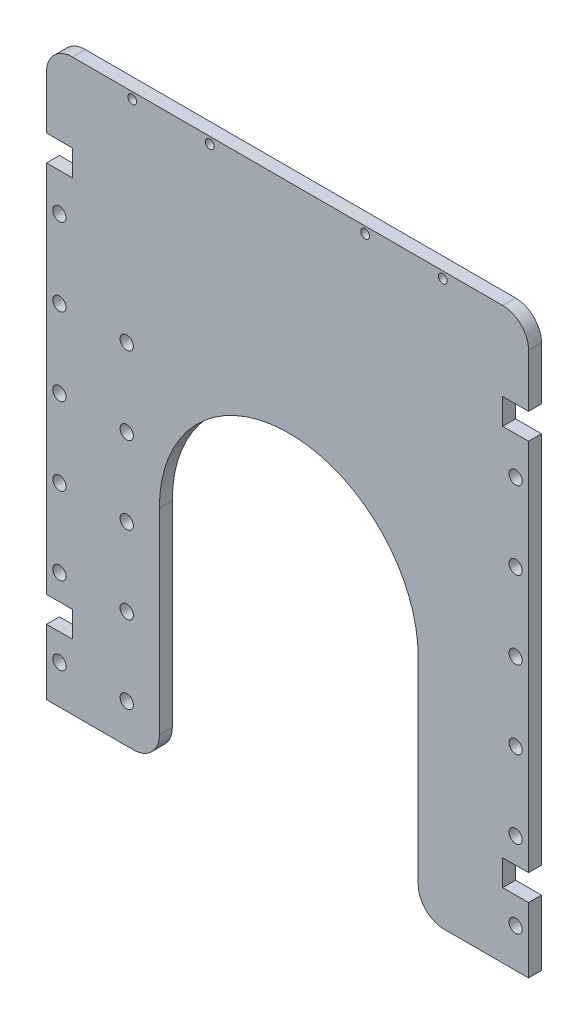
ISO-10303-21;
HEADER;
FILE_DESCRIPTION(('STEP AP214'),'2;1');
FILE_NAME('part.step','',(''),(''),'','','');
FILE_SCHEMA(('AUTOMOTIVE_DESIGN { 1 0 10303 214 1 1 1 1 }'));
ENDSEC;
DATA;
#1=APPLICATION_CONTEXT('core data for automotive mechanical design processes');
#2=APPLICATION_PROTOCOL_DEFINITION('international standard','automotive_design',2000,#1);
#3=PRODUCT_CONTEXT('',#1,'mechanical');
#4=PRODUCT('Part','Part','',(#3));
#5=PRODUCT_RELATED_PRODUCT_CATEGORY('part','',(#4));
#6=PRODUCT_DEFINITION_FORMATION('','',#4);
#7=PRODUCT_DEFINITION_CONTEXT('part definition',#1,'design');
#8=PRODUCT_DEFINITION('design','',#6,#7);
#9=PRODUCT_DEFINITION_SHAPE('','',#8);
#10=(LENGTH_UNIT() NAMED_UNIT(*) SI_UNIT(.MILLI.,.METRE.));
#11=(NAMED_UNIT(*) PLANE_ANGLE_UNIT() SI_UNIT($,.RADIAN.));
#12=(NAMED_UNIT(*) SI_UNIT($,.STERADIAN.) SOLID_ANGLE_UNIT());
#13=UNCERTAINTY_MEASURE_WITH_UNIT(LENGTH_MEASURE(1.E-05),#10,'distance_accuracy_value','');
#14=(GEOMETRIC_REPRESENTATION_CONTEXT(3) GLOBAL_UNCERTAINTY_ASSIGNED_CONTEXT((#13)) GLOBAL_UNIT_ASSIGNED_CONTEXT((#10,
#11,#12)) REPRESENTATION_CONTEXT('',''));
#15=CARTESIAN_POINT('',(0.,0.,0.));
#16=DIRECTION('',(0.,0.,1.));
#17=DIRECTION('',(1.,0.,0.));
#18=AXIS2_PLACEMENT_3D('',#15,#16,#17);
#19=CARTESIAN_POINT('',(0.,0.,-6.35));
#20=DIRECTION('',(-1.,0.,0.));
#21=DIRECTION('',(0.,0.,1.));
#22=AXIS2_PLACEMENT_3D('',#19,#20,#21);
#23=PLANE('',#22);
#24=DIRECTION('',(0.,0.,1.));
#25=VECTOR('',#24,1.);
#26=CARTESIAN_POINT('',(0.,44.74,-12.7));
#27=LINE('',#26,#25);
#28=CARTESIAN_POINT('',(0.,44.74,-6.35));
#29=VERTEX_POINT('',#28);
#30=CARTESIAN_POINT('',(0.,44.74,0.));
#31=VERTEX_POINT('',#30);
#32=EDGE_CURVE('E243',#29,#31,#27,.T.);
#33=ORIENTED_EDGE('',*,*,#32,.T.);
#34=DIRECTION('',(0.,-1.,0.));
#35=VECTOR('',#34,1.);
#36=CARTESIAN_POINT('',(0.,0.,0.));
#37=LINE('',#36,#35);
#38=CARTESIAN_POINT('',(0.,228.04,0.));
#39=VERTEX_POINT('',#38);
#40=EDGE_CURVE('E474',#39,#31,#37,.T.);
#41=ORIENTED_EDGE('',*,*,#40,.F.);
#42=DIRECTION('',(0.,0.,1.));
#43=VECTOR('',#42,1.);
#44=CARTESIAN_POINT('',(0.,228.04,-12.7));
#45=LINE('',#44,#43);
#46=CARTESIAN_POINT('',(0.,228.04,-6.35));
#47=VERTEX_POINT('',#46);
#48=EDGE_CURVE('E309',#47,#39,#45,.T.);
#49=ORIENTED_EDGE('',*,*,#48,.F.);
#50=DIRECTION('',(0.,-1.,0.));
#51=VECTOR('',#50,1.);
#52=CARTESIAN_POINT('',(0.,0.,-6.35));
#53=LINE('',#52,#51);
#54=EDGE_CURVE('E450',#47,#29,#53,.T.);
#55=ORIENTED_EDGE('',*,*,#54,.T.);
#56=EDGE_LOOP('',(#33,#41,#49,#55));
#57=FACE_BOUND('',#56,.T.);
#58=ADVANCED_FACE('F33',(#57),#23,.T.);
#59=CARTESIAN_POINT('',(236.5,0.,-6.35));
#60=DIRECTION('',(1.,0.,0.));
#61=DIRECTION('',(0.,0.,-1.));
#62=AXIS2_PLACEMENT_3D('',#59,#60,#61);
#63=PLANE('',#62);
#64=DIRECTION('',(0.,0.,1.));
#65=VECTOR('',#64,1.);
#66=CARTESIAN_POINT('',(236.5,44.74,-12.7));
#67=LINE('',#66,#65);
#68=CARTESIAN_POINT('',(236.5,44.74,-6.35));
#69=VERTEX_POINT('',#68);
#70=CARTESIAN_POINT('',(236.5,44.74,0.));
#71=VERTEX_POINT('',#70);
#72=EDGE_CURVE('E263',#69,#71,#67,.T.);
#73=ORIENTED_EDGE('',*,*,#72,.F.);
#74=DIRECTION('',(0.,1.,0.));
#75=VECTOR('',#74,1.);
#76=CARTESIAN_POINT('',(236.5,0.,-6.35));
#77=LINE('',#76,#75);
#78=CARTESIAN_POINT('',(236.5,228.04,-6.35));
#79=VERTEX_POINT('',#78);
#80=EDGE_CURVE('E442',#69,#79,#77,.T.);
#81=ORIENTED_EDGE('',*,*,#80,.T.);
#82=DIRECTION('',(0.,0.,1.));
#83=VECTOR('',#82,1.);
#84=CARTESIAN_POINT('',(236.5,228.04,-12.7));
#85=LINE('',#84,#83);
#86=CARTESIAN_POINT('',(236.5,228.04,0.));
#87=VERTEX_POINT('',#86);
#88=EDGE_CURVE('E288',#79,#87,#85,.T.);
#89=ORIENTED_EDGE('',*,*,#88,.T.);
#90=DIRECTION('',(0.,1.,0.));
#91=VECTOR('',#90,1.);
#92=CARTESIAN_POINT('',(236.5,0.,0.));
#93=LINE('',#92,#91);
#94=EDGE_CURVE('E468',#71,#87,#93,.T.);
#95=ORIENTED_EDGE('',*,*,#94,.F.);
#96=EDGE_LOOP('',(#73,#81,#89,#95));
#97=FACE_BOUND('',#96,.T.);
#98=ADVANCED_FACE('F577',(#97),#63,.T.);
#99=DIRECTION('',(0.,0.,1.));
#100=VECTOR('',#99,1.);
#101=CARTESIAN_POINT('',(236.5,240.74,-12.7));
#102=LINE('',#101,#100);
#103=CARTESIAN_POINT('',(236.5,240.74,-6.35));
#104=VERTEX_POINT('',#103);
#105=CARTESIAN_POINT('',(236.5,240.74,0.));
#106=VERTEX_POINT('',#105);
#107=EDGE_CURVE('E286',#104,#106,#102,.T.);
#108=ORIENTED_EDGE('',*,*,#107,.F.);
#109=CARTESIAN_POINT('',(236.5,266.7,-6.35));
#110=VERTEX_POINT('',#109);
#111=EDGE_CURVE('E437',#104,#110,#77,.T.);
#112=ORIENTED_EDGE('',*,*,#111,.T.);
#113=DIRECTION('',(0.,0.,1.));
#114=VECTOR('',#113,1.);
#115=CARTESIAN_POINT('',(236.5,266.7,-6.35));
#116=LINE('',#115,#114);
#117=CARTESIAN_POINT('',(236.5,266.7,0.));
#118=VERTEX_POINT('',#117);
#119=EDGE_CURVE('E478',#110,#118,#116,.T.);
#120=ORIENTED_EDGE('',*,*,#119,.T.);
#121=EDGE_CURVE('E463',#106,#118,#93,.T.);
#122=ORIENTED_EDGE('',*,*,#121,.F.);
#123=EDGE_LOOP('',(#108,#112,#120,#122));
#124=FACE_BOUND('',#123,.T.);
#125=ADVANCED_FACE('F592',(#124),#63,.T.);
#126=DIRECTION('',(0.,0.,1.));
#127=VECTOR('',#126,1.);
#128=CARTESIAN_POINT('',(0.,32.04,-12.7));
#129=LINE('',#128,#127);
#130=CARTESIAN_POINT('',(0.,32.04,-6.35));
#131=VERTEX_POINT('',#130);
#132=CARTESIAN_POINT('',(0.,32.04,0.));
#133=VERTEX_POINT('',#132);
#134=EDGE_CURVE('E48',#131,#133,#129,.T.);
#135=ORIENTED_EDGE('',*,*,#134,.F.);
#136=CARTESIAN_POINT('',(0.,0.,-6.35));
#137=VERTEX_POINT('',#136);
#138=EDGE_CURVE('E445',#131,#137,#53,.T.);
#139=ORIENTED_EDGE('',*,*,#138,.T.);
#140=DIRECTION('',(0.,0.,1.));
#141=VECTOR('',#140,1.);
#142=CARTESIAN_POINT('',(0.,0.,-6.35));
#143=LINE('',#142,#141);
#144=CARTESIAN_POINT('',(0.,0.,0.));
#145=VERTEX_POINT('',#144);
#146=EDGE_CURVE('E475',#137,#145,#143,.T.);
#147=ORIENTED_EDGE('',*,*,#146,.T.);
#148=EDGE_CURVE('E471',#133,#145,#37,.T.);
#149=ORIENTED_EDGE('',*,*,#148,.F.);
#150=EDGE_LOOP('',(#135,#139,#147,#149));
#151=FACE_BOUND('',#150,.T.);
#152=ADVANCED_FACE('F527',(#151),#23,.T.);
#153=CARTESIAN_POINT('',(55.372,0.,-6.35));
#154=DIRECTION('',(0.,-1.,0.));
#155=DIRECTION('',(1.,0.,0.));
#156=AXIS2_PLACEMENT_3D('',#153,#154,#155);
#157=PLANE('',#156);
#158=DIRECTION('',(1.,0.,0.));
#159=VECTOR('',#158,1.);
#160=CARTESIAN_POINT('',(55.372,0.,-6.35));
#161=LINE('',#160,#159);
#162=CARTESIAN_POINT('',(42.672,0.,-6.35));
#163=VERTEX_POINT('',#162);
#164=EDGE_CURVE('E424',#137,#163,#161,.T.);
#165=ORIENTED_EDGE('',*,*,#164,.T.);
#166=DIRECTION('',(0.,0.,1.));
#167=VECTOR('',#166,1.);
#168=CARTESIAN_POINT('',(42.672,0.,-6.35));
#169=LINE('',#168,#167);
#170=CARTESIAN_POINT('',(42.672,0.,0.));
#171=VERTEX_POINT('',#170);
#172=EDGE_CURVE('E41',#163,#171,#169,.T.);
#173=ORIENTED_EDGE('',*,*,#172,.T.);
#174=DIRECTION('',(1.,0.,0.));
#175=VECTOR('',#174,1.);
#176=CARTESIAN_POINT('',(55.372,0.,0.));
#177=LINE('',#176,#175);
#178=EDGE_CURVE('E421',#145,#171,#177,.T.);
#179=ORIENTED_EDGE('',*,*,#178,.F.);
#180=ORIENTED_EDGE('',*,*,#146,.F.);
#181=EDGE_LOOP('',(#165,#173,#179,#180));
#182=FACE_BOUND('',#181,.T.);
#183=ADVANCED_FACE('F520',(#182),#157,.T.);
#184=DIRECTION('',(0.,0.,1.));
#185=VECTOR('',#184,1.);
#186=CARTESIAN_POINT('',(0.,240.74,-12.7));
#187=LINE('',#186,#185);
#188=CARTESIAN_POINT('',(0.,240.74,-6.35));
#189=VERTEX_POINT('',#188);
#190=CARTESIAN_POINT('',(0.,240.74,0.));
#191=VERTEX_POINT('',#190);
#192=EDGE_CURVE('E311',#189,#191,#187,.T.);
#193=ORIENTED_EDGE('',*,*,#192,.T.);
#194=CARTESIAN_POINT('',(0.,266.7,0.));
#195=VERTEX_POINT('',#194);
#196=EDGE_CURVE('E428',#195,#191,#37,.T.);
#197=ORIENTED_EDGE('',*,*,#196,.F.);
#198=DIRECTION('',(0.,0.,1.));
#199=VECTOR('',#198,1.);
#200=CARTESIAN_POINT('',(0.,266.7,-6.35));
#201=LINE('',#200,#199);
#202=CARTESIAN_POINT('',(0.,266.7,-6.35));
#203=VERTEX_POINT('',#202);
#204=EDGE_CURVE('E502',#195,#203,#201,.F.);
#205=ORIENTED_EDGE('',*,*,#204,.T.);
#206=EDGE_CURVE('E446',#203,#189,#53,.T.);
#207=ORIENTED_EDGE('',*,*,#206,.T.);
#208=EDGE_LOOP('',(#193,#197,#205,#207));
#209=FACE_BOUND('',#208,.T.);
#210=ADVANCED_FACE('F607',(#209),#23,.T.);
#211=CARTESIAN_POINT('',(236.5,279.4,-6.35));
#212=DIRECTION('',(0.,1.,0.));
#213=DIRECTION('',(-1.,0.,0.));
#214=AXIS2_PLACEMENT_3D('',#211,#212,#213);
#215=PLANE('',#214);
#216=DIRECTION('',(-1.,0.,0.));
#217=VECTOR('',#216,1.);
#218=CARTESIAN_POINT('',(236.5,279.4,0.));
#219=LINE('',#218,#217);
#220=CARTESIAN_POINT('',(223.8,279.4,0.));
#221=VERTEX_POINT('',#220);
#222=CARTESIAN_POINT('',(12.7,279.4,0.));
#223=VERTEX_POINT('',#222);
#224=EDGE_CURVE('E467',#221,#223,#219,.T.);
#225=ORIENTED_EDGE('',*,*,#224,.F.);
#226=DIRECTION('',(0.,0.,1.));
#227=VECTOR('',#226,1.);
#228=CARTESIAN_POINT('',(223.8,279.4,-6.35));
#229=LINE('',#228,#227);
#230=CARTESIAN_POINT('',(223.8,279.4,-6.35));
#231=VERTEX_POINT('',#230);
#232=EDGE_CURVE('E495',#221,#231,#229,.F.);
#233=ORIENTED_EDGE('',*,*,#232,.T.);
#234=DIRECTION('',(-1.,0.,0.));
#235=VECTOR('',#234,1.);
#236=CARTESIAN_POINT('',(236.5,279.4,-6.35));
#237=LINE('',#236,#235);
#238=CARTESIAN_POINT('',(12.7,279.4,-6.35));
#239=VERTEX_POINT('',#238);
#240=EDGE_CURVE('E441',#231,#239,#237,.T.);
#241=ORIENTED_EDGE('',*,*,#240,.T.);
#242=DIRECTION('',(0.,0.,1.));
#243=VECTOR('',#242,1.);
#244=CARTESIAN_POINT('',(12.7,279.4,-6.35));
#245=LINE('',#244,#243);
#246=EDGE_CURVE('E492',#239,#223,#245,.T.);
#247=ORIENTED_EDGE('',*,*,#246,.T.);
#248=EDGE_LOOP('',(#225,#233,#241,#247));
#249=FACE_BOUND('',#248,.T.);
#250=ADVANCED_FACE('F600',(#249),#215,.T.);
#251=DIRECTION('',(0.,0.,1.));
#252=VECTOR('',#251,1.);
#253=CARTESIAN_POINT('',(236.5,32.04,-12.7));
#254=LINE('',#253,#252);
#255=CARTESIAN_POINT('',(236.5,32.04,-6.35));
#256=VERTEX_POINT('',#255);
#257=CARTESIAN_POINT('',(236.5,32.04,0.));
#258=VERTEX_POINT('',#257);
#259=EDGE_CURVE('E265',#256,#258,#254,.T.);
#260=ORIENTED_EDGE('',*,*,#259,.T.);
#261=CARTESIAN_POINT('',(236.5,0.,0.));
#262=VERTEX_POINT('',#261);
#263=EDGE_CURVE('E464',#262,#258,#93,.T.);
#264=ORIENTED_EDGE('',*,*,#263,.F.);
#265=DIRECTION('',(0.,0.,1.));
#266=VECTOR('',#265,1.);
#267=CARTESIAN_POINT('',(236.5,0.,-6.35));
#268=LINE('',#267,#266);
#269=CARTESIAN_POINT('',(236.5,0.,-6.35));
#270=VERTEX_POINT('',#269);
#271=EDGE_CURVE('E479',#270,#262,#268,.T.);
#272=ORIENTED_EDGE('',*,*,#271,.F.);
#273=EDGE_CURVE('E438',#270,#256,#77,.T.);
#274=ORIENTED_EDGE('',*,*,#273,.T.);
#275=EDGE_LOOP('',(#260,#264,#272,#274));
#276=FACE_BOUND('',#275,.T.);
#277=ADVANCED_FACE('F561',(#276),#63,.T.);
#278=CARTESIAN_POINT('',(182.372,0.,-6.35));
#279=DIRECTION('',(0.,-1.,0.));
#280=DIRECTION('',(1.,0.,0.));
#281=AXIS2_PLACEMENT_3D('',#278,#279,#280);
#282=PLANE('',#281);
#283=DIRECTION('',(1.,0.,0.));
#284=VECTOR('',#283,1.);
#285=CARTESIAN_POINT('',(182.372,0.,0.));
#286=LINE('',#285,#284);
#287=CARTESIAN_POINT('',(195.072,0.,0.));
#288=VERTEX_POINT('',#287);
#289=EDGE_CURVE('E461',#288,#262,#286,.T.);
#290=ORIENTED_EDGE('',*,*,#289,.F.);
#291=DIRECTION('',(0.,0.,1.));
#292=VECTOR('',#291,1.);
#293=CARTESIAN_POINT('',(195.072,0.,-6.35));
#294=LINE('',#293,#292);
#295=CARTESIAN_POINT('',(195.072,0.,-6.35));
#296=VERTEX_POINT('',#295);
#297=EDGE_CURVE('E511',#288,#296,#294,.F.);
#298=ORIENTED_EDGE('',*,*,#297,.T.);
#299=DIRECTION('',(1.,0.,0.));
#300=VECTOR('',#299,1.);
#301=CARTESIAN_POINT('',(182.372,0.,-6.35));
#302=LINE('',#301,#300);
#303=EDGE_CURVE('E435',#296,#270,#302,.T.);
#304=ORIENTED_EDGE('',*,*,#303,.T.);
#305=ORIENTED_EDGE('',*,*,#271,.T.);
#306=EDGE_LOOP('',(#290,#298,#304,#305));
#307=FACE_BOUND('',#306,.T.);
#308=ADVANCED_FACE('F552',(#307),#282,.T.);
#309=CARTESIAN_POINT('',(182.372,109.22,-6.35));
#310=DIRECTION('',(-1.,0.,0.));
#311=DIRECTION('',(0.,0.,1.));
#312=AXIS2_PLACEMENT_3D('',#309,#310,#311);
#313=PLANE('',#312);
#314=DIRECTION('',(0.,-1.,0.));
#315=VECTOR('',#314,1.);
#316=CARTESIAN_POINT('',(182.372,109.22,-6.35));
#317=LINE('',#316,#315);
#318=CARTESIAN_POINT('',(182.372,109.22,-6.35));
#319=VERTEX_POINT('',#318);
#320=CARTESIAN_POINT('',(182.372,12.7,-6.35));
#321=VERTEX_POINT('',#320);
#322=EDGE_CURVE('E432',#319,#321,#317,.T.);
#323=ORIENTED_EDGE('',*,*,#322,.T.);
#324=DIRECTION('',(0.,0.,1.));
#325=VECTOR('',#324,1.);
#326=CARTESIAN_POINT('',(182.372,12.7,-6.35));
#327=LINE('',#326,#325);
#328=CARTESIAN_POINT('',(182.372,12.7,0.));
#329=VERTEX_POINT('',#328);
#330=EDGE_CURVE('E504',#321,#329,#327,.T.);
#331=ORIENTED_EDGE('',*,*,#330,.T.);
#332=DIRECTION('',(0.,-1.,0.));
#333=VECTOR('',#332,1.);
#334=CARTESIAN_POINT('',(182.372,109.22,0.));
#335=LINE('',#334,#333);
#336=CARTESIAN_POINT('',(182.372,109.22,0.));
#337=VERTEX_POINT('',#336);
#338=EDGE_CURVE('E458',#337,#329,#335,.T.);
#339=ORIENTED_EDGE('',*,*,#338,.F.);
#340=DIRECTION('',(0.,0.,1.));
#341=VECTOR('',#340,1.);
#342=CARTESIAN_POINT('',(182.372,109.22,-6.35));
#343=LINE('',#342,#341);
#344=EDGE_CURVE('E482',#319,#337,#343,.T.);
#345=ORIENTED_EDGE('',*,*,#344,.F.);
#346=EDGE_LOOP('',(#323,#331,#339,#345));
#347=FACE_BOUND('',#346,.T.);
#348=ADVANCED_FACE('F546',(#347),#313,.T.);
#349=CARTESIAN_POINT('',(118.872,109.22,-6.35));
#350=DIRECTION('',(0.,0.,1.));
#351=DIRECTION('',(1.,0.,0.));
#352=AXIS2_PLACEMENT_3D('',#349,#350,#351);
#353=CYLINDRICAL_SURFACE('',#352,63.5);
#354=CARTESIAN_POINT('',(118.872,109.22,0.));
#355=DIRECTION('',(0.,0.,-1.));
#356=DIRECTION('',(-1.,0.,0.));
#357=AXIS2_PLACEMENT_3D('',#354,#355,#356);
#358=CIRCLE('',#357,63.5);
#359=CARTESIAN_POINT('',(55.372,109.22,0.));
#360=VERTEX_POINT('',#359);
#361=EDGE_CURVE('E455',#360,#337,#358,.T.);
#362=ORIENTED_EDGE('',*,*,#361,.F.);
#363=DIRECTION('',(0.,0.,1.));
#364=VECTOR('',#363,1.);
#365=CARTESIAN_POINT('',(55.372,109.22,-6.35));
#366=LINE('',#365,#364);
#367=CARTESIAN_POINT('',(55.372,109.22,-6.35));
#368=VERTEX_POINT('',#367);
#369=EDGE_CURVE('E449',#368,#360,#366,.T.);
#370=ORIENTED_EDGE('',*,*,#369,.F.);
#371=CARTESIAN_POINT('',(118.872,109.22,-6.35));
#372=DIRECTION('',(0.,0.,-1.));
#373=DIRECTION('',(-1.,0.,0.));
#374=AXIS2_PLACEMENT_3D('',#371,#372,#373);
#375=CIRCLE('',#374,63.5);
#376=EDGE_CURVE('E430',#368,#319,#375,.T.);
#377=ORIENTED_EDGE('',*,*,#376,.T.);
#378=ORIENTED_EDGE('',*,*,#344,.T.);
#379=EDGE_LOOP('',(#362,#370,#377,#378));
#380=FACE_BOUND('',#379,.T.);
#381=ADVANCED_FACE('F541',(#380),#353,.F.);
#382=CARTESIAN_POINT('',(55.372,0.,-6.35));
#383=DIRECTION('',(1.,0.,0.));
#384=DIRECTION('',(0.,0.,-1.));
#385=AXIS2_PLACEMENT_3D('',#382,#383,#384);
#386=PLANE('',#385);
#387=DIRECTION('',(0.,1.,0.));
#388=VECTOR('',#387,1.);
#389=CARTESIAN_POINT('',(55.372,0.,0.));
#390=LINE('',#389,#388);
#391=CARTESIAN_POINT('',(55.372,12.7,0.));
#392=VERTEX_POINT('',#391);
#393=EDGE_CURVE('E453',#392,#360,#390,.T.);
#394=ORIENTED_EDGE('',*,*,#393,.F.);
#395=DIRECTION('',(0.,0.,1.));
#396=VECTOR('',#395,1.);
#397=CARTESIAN_POINT('',(55.372,12.7,-6.35));
#398=LINE('',#397,#396);
#399=CARTESIAN_POINT('',(55.372,12.7,-6.35));
#400=VERTEX_POINT('',#399);
#401=EDGE_CURVE('E11',#392,#400,#398,.F.);
#402=ORIENTED_EDGE('',*,*,#401,.T.);
#403=DIRECTION('',(0.,1.,0.));
#404=VECTOR('',#403,1.);
#405=CARTESIAN_POINT('',(55.372,0.,-6.35));
#406=LINE('',#405,#404);
#407=EDGE_CURVE('E427',#400,#368,#406,.T.);
#408=ORIENTED_EDGE('',*,*,#407,.T.);
#409=ORIENTED_EDGE('',*,*,#369,.T.);
#410=EDGE_LOOP('',(#394,#402,#408,#409));
#411=FACE_BOUND('',#410,.T.);
#412=ADVANCED_FACE('F537',(#411),#386,.T.);
#413=CARTESIAN_POINT('',(118.872,109.22,-6.35));
#414=DIRECTION('',(0.,0.,-1.));
#415=DIRECTION('',(-1.,0.,0.));
#416=AXIS2_PLACEMENT_3D('',#413,#414,#415);
#417=PLANE('',#416);
#418=CARTESIAN_POINT('',(80.15,276.098,-6.35));
#419=DIRECTION('',(0.,0.,1.));
#420=DIRECTION('',(-1.,0.,0.));
#421=AXIS2_PLACEMENT_3D('',#418,#419,#420);
#422=CIRCLE('',#421,2.15000000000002);
#423=CARTESIAN_POINT('',(78.,276.098,-6.35));
#424=VERTEX_POINT('',#423);
#425=EDGE_CURVE('E853',#424,#424,#422,.T.);
#426=ORIENTED_EDGE('',*,*,#425,.T.);
#427=EDGE_LOOP('',(#426));
#428=FACE_BOUND('',#427,.T.);
#429=CARTESIAN_POINT('',(42.05,276.098,-6.35));
#430=DIRECTION('',(0.,0.,1.));
#431=DIRECTION('',(-1.,0.,0.));
#432=AXIS2_PLACEMENT_3D('',#429,#430,#431);
#433=CIRCLE('',#432,2.15000000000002);
#434=CARTESIAN_POINT('',(39.9,276.098,-6.35));
#435=VERTEX_POINT('',#434);
#436=EDGE_CURVE('E857',#435,#435,#433,.T.);
#437=ORIENTED_EDGE('',*,*,#436,.T.);
#438=EDGE_LOOP('',(#437));
#439=FACE_BOUND('',#438,.T.);
#440=CARTESIAN_POINT('',(156.35,276.098,-6.35));
#441=DIRECTION('',(0.,0.,1.));
#442=DIRECTION('',(1.,0.,0.));
#443=AXIS2_PLACEMENT_3D('',#440,#441,#442);
#444=CIRCLE('',#443,2.15000000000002);
#445=CARTESIAN_POINT('',(158.5,276.098,-6.35));
#446=VERTEX_POINT('',#445);
#447=EDGE_CURVE('E861',#446,#446,#444,.T.);
#448=ORIENTED_EDGE('',*,*,#447,.T.);
#449=EDGE_LOOP('',(#448));
#450=FACE_BOUND('',#449,.T.);
#451=CARTESIAN_POINT('',(194.45,276.098,-6.35));
#452=DIRECTION('',(0.,0.,1.));
#453=DIRECTION('',(1.,0.,0.));
#454=AXIS2_PLACEMENT_3D('',#451,#452,#453);
#455=CIRCLE('',#454,2.15000000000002);
#456=CARTESIAN_POINT('',(196.6,276.098,-6.35));
#457=VERTEX_POINT('',#456);
#458=EDGE_CURVE('E234',#457,#457,#455,.T.);
#459=ORIENTED_EDGE('',*,*,#458,.T.);
#460=EDGE_LOOP('',(#459));
#461=FACE_BOUND('',#460,.T.);
#462=DIRECTION('',(1.,0.,0.));
#463=VECTOR('',#462,1.);
#464=CARTESIAN_POINT('',(118.872,44.74,-6.35));
#465=LINE('',#464,#463);
#466=CARTESIAN_POINT('',(12.7,44.74,-6.35));
#467=VERTEX_POINT('',#466);
#468=EDGE_CURVE('E251',#29,#467,#465,.T.);
#469=ORIENTED_EDGE('',*,*,#468,.F.);
#470=ORIENTED_EDGE('',*,*,#54,.F.);
#471=DIRECTION('',(-1.,0.,0.));
#472=VECTOR('',#471,1.);
#473=CARTESIAN_POINT('',(118.872,228.04,-6.35));
#474=LINE('',#473,#472);
#475=CARTESIAN_POINT('',(12.7,228.04,-6.35));
#476=VERTEX_POINT('',#475);
#477=EDGE_CURVE('E317',#476,#47,#474,.T.);
#478=ORIENTED_EDGE('',*,*,#477,.F.);
#479=DIRECTION('',(0.,-1.,0.));
#480=VECTOR('',#479,1.);
#481=CARTESIAN_POINT('',(12.7,109.22,-6.35));
#482=LINE('',#481,#480);
#483=CARTESIAN_POINT('',(12.7,240.74,-6.35));
#484=VERTEX_POINT('',#483);
#485=EDGE_CURVE('E319',#484,#476,#482,.T.);
#486=ORIENTED_EDGE('',*,*,#485,.F.);
#487=DIRECTION('',(1.,0.,0.));
#488=VECTOR('',#487,1.);
#489=CARTESIAN_POINT('',(118.872,240.74,-6.35));
#490=LINE('',#489,#488);
#491=EDGE_CURVE('E308',#189,#484,#490,.T.);
#492=ORIENTED_EDGE('',*,*,#491,.F.);
#493=ORIENTED_EDGE('',*,*,#206,.F.);
#494=CARTESIAN_POINT('',(12.7,266.7,-6.35));
#495=DIRECTION('',(0.,0.,-1.));
#496=DIRECTION('',(-1.,0.,0.));
#497=AXIS2_PLACEMENT_3D('',#494,#495,#496);
#498=CIRCLE('',#497,12.7);
#499=EDGE_CURVE('E497',#203,#239,#498,.T.);
#500=ORIENTED_EDGE('',*,*,#499,.T.);
#501=ORIENTED_EDGE('',*,*,#240,.F.);
#502=CARTESIAN_POINT('',(223.8,266.7,-6.35));
#503=DIRECTION('',(0.,0.,-1.));
#504=DIRECTION('',(-1.,0.,0.));
#505=AXIS2_PLACEMENT_3D('',#502,#503,#504);
#506=CIRCLE('',#505,12.7);
#507=EDGE_CURVE('E499',#231,#110,#506,.T.);
#508=ORIENTED_EDGE('',*,*,#507,.T.);
#509=ORIENTED_EDGE('',*,*,#111,.F.);
#510=DIRECTION('',(1.,-1.70467314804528E-13,0.));
#511=VECTOR('',#510,1.);
#512=CARTESIAN_POINT('',(118.872000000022,240.74000000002,-6.35));
#513=LINE('',#512,#511);
#514=CARTESIAN_POINT('',(223.799999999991,240.740000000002,-6.35));
#515=VERTEX_POINT('',#514);
#516=EDGE_CURVE('E294',#515,#104,#513,.T.);
#517=ORIENTED_EDGE('',*,*,#516,.F.);
#518=DIRECTION('',(0.,1.,0.));
#519=VECTOR('',#518,1.);
#520=CARTESIAN_POINT('',(223.799999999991,109.22,-6.35));
#521=LINE('',#520,#519);
#522=CARTESIAN_POINT('',(223.799999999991,228.040000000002,-6.35));
#523=VERTEX_POINT('',#522);
#524=EDGE_CURVE('E296',#523,#515,#521,.T.);
#525=ORIENTED_EDGE('',*,*,#524,.F.);
#526=DIRECTION('',(-1.,1.70467314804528E-13,0.));
#527=VECTOR('',#526,1.);
#528=CARTESIAN_POINT('',(118.87200000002,228.04000000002,-6.35));
#529=LINE('',#528,#527);
#530=EDGE_CURVE('E285',#79,#523,#529,.T.);
#531=ORIENTED_EDGE('',*,*,#530,.F.);
#532=ORIENTED_EDGE('',*,*,#80,.F.);
#533=DIRECTION('',(1.,0.,0.));
#534=VECTOR('',#533,1.);
#535=CARTESIAN_POINT('',(118.872,44.74,-6.35));
#536=LINE('',#535,#534);
#537=CARTESIAN_POINT('',(223.8,44.74,-6.35));
#538=VERTEX_POINT('',#537);
#539=EDGE_CURVE('E270',#538,#69,#536,.T.);
#540=ORIENTED_EDGE('',*,*,#539,.F.);
#541=DIRECTION('',(0.,1.,0.));
#542=VECTOR('',#541,1.);
#543=CARTESIAN_POINT('',(223.8,109.22,-6.35));
#544=LINE('',#543,#542);
#545=CARTESIAN_POINT('',(223.8,32.04,-6.35));
#546=VERTEX_POINT('',#545);
#547=EDGE_CURVE('E272',#546,#538,#544,.T.);
#548=ORIENTED_EDGE('',*,*,#547,.F.);
#549=DIRECTION('',(-1.,0.,0.));
#550=VECTOR('',#549,1.);
#551=CARTESIAN_POINT('',(118.872,32.04,-6.35));
#552=LINE('',#551,#550);
#553=EDGE_CURVE('E262',#256,#546,#552,.T.);
#554=ORIENTED_EDGE('',*,*,#553,.F.);
#555=ORIENTED_EDGE('',*,*,#273,.F.);
#556=ORIENTED_EDGE('',*,*,#303,.F.);
#557=CARTESIAN_POINT('',(195.072,12.7,-6.35));
#558=DIRECTION('',(0.,0.,-1.));
#559=DIRECTION('',(-1.,0.,0.));
#560=AXIS2_PLACEMENT_3D('',#557,#558,#559);
#561=CIRCLE('',#560,12.7);
#562=EDGE_CURVE('E515',#296,#321,#561,.T.);
#563=ORIENTED_EDGE('',*,*,#562,.T.);
#564=ORIENTED_EDGE('',*,*,#322,.F.);
#565=ORIENTED_EDGE('',*,*,#376,.F.);
#566=ORIENTED_EDGE('',*,*,#407,.F.);
#567=CARTESIAN_POINT('',(42.672,12.7,-6.35));
#568=DIRECTION('',(0.,0.,-1.));
#569=DIRECTION('',(-1.,0.,0.));
#570=AXIS2_PLACEMENT_3D('',#567,#568,#569);
#571=CIRCLE('',#570,12.7);
#572=EDGE_CURVE('E513',#400,#163,#571,.T.);
#573=ORIENTED_EDGE('',*,*,#572,.T.);
#574=ORIENTED_EDGE('',*,*,#164,.F.);
#575=ORIENTED_EDGE('',*,*,#138,.F.);
#576=DIRECTION('',(-1.,0.,0.));
#577=VECTOR('',#576,1.);
#578=CARTESIAN_POINT('',(118.872,32.04,-6.35));
#579=LINE('',#578,#577);
#580=CARTESIAN_POINT('',(12.7,32.04,-6.35));
#581=VERTEX_POINT('',#580);
#582=EDGE_CURVE('E246',#581,#131,#579,.T.);
#583=ORIENTED_EDGE('',*,*,#582,.F.);
#584=DIRECTION('',(0.,-1.,0.));
#585=VECTOR('',#584,1.);
#586=CARTESIAN_POINT('',(12.7,109.22,-6.35));
#587=LINE('',#586,#585);
#588=EDGE_CURVE('E226',#467,#581,#587,.T.);
#589=ORIENTED_EDGE('',*,*,#588,.F.);
#590=EDGE_LOOP('',(#469,#470,#478,#486,#492,#493,#500,#501,#508,#509,#517,#525,#531,#532,#540,
#548,#554,#555,#556,#563,#564,#565,#566,#573,#574,#575,#583,#589));
#591=FACE_BOUND('',#590,.T.);
#592=CARTESIAN_POINT('',(39.3600000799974,171.45,-6.35));
#593=DIRECTION('',(0.,0.,1.));
#594=DIRECTION('',(1.,0.,0.));
#595=AXIS2_PLACEMENT_3D('',#592,#593,#594);
#596=CIRCLE('',#595,3.24999999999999);
#597=CARTESIAN_POINT('',(42.6100000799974,171.45,-6.35));
#598=VERTEX_POINT('',#597);
#599=EDGE_CURVE('E322',#598,#598,#596,.T.);
#600=ORIENTED_EDGE('',*,*,#599,.T.);
#601=EDGE_LOOP('',(#600));
#602=FACE_BOUND('',#601,.T.);
#603=CARTESIAN_POINT('',(39.3600000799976,133.35,-6.35));
#604=DIRECTION('',(0.,0.,1.));
#605=DIRECTION('',(1.,0.,0.));
#606=AXIS2_PLACEMENT_3D('',#603,#604,#605);
#607=CIRCLE('',#606,3.25);
#608=CARTESIAN_POINT('',(42.6100000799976,133.35,-6.35));
#609=VERTEX_POINT('',#608);
#610=EDGE_CURVE('E328',#609,#609,#607,.T.);
#611=ORIENTED_EDGE('',*,*,#610,.T.);
#612=EDGE_LOOP('',(#611));
#613=FACE_BOUND('',#612,.T.);
#614=CARTESIAN_POINT('',(39.3600000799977,95.25,-6.35));
#615=DIRECTION('',(0.,0.,1.));
#616=DIRECTION('',(1.,0.,0.));
#617=AXIS2_PLACEMENT_3D('',#614,#615,#616);
#618=CIRCLE('',#617,3.25);
#619=CARTESIAN_POINT('',(42.6100000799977,95.25,-6.35));
#620=VERTEX_POINT('',#619);
#621=EDGE_CURVE('E334',#620,#620,#618,.T.);
#622=ORIENTED_EDGE('',*,*,#621,.T.);
#623=EDGE_LOOP('',(#622));
#624=FACE_BOUND('',#623,.T.);
#625=CARTESIAN_POINT('',(39.3600000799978,57.15,-6.35));
#626=DIRECTION('',(0.,0.,1.));
#627=DIRECTION('',(1.,0.,0.));
#628=AXIS2_PLACEMENT_3D('',#625,#626,#627);
#629=CIRCLE('',#628,3.25);
#630=CARTESIAN_POINT('',(42.6100000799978,57.15,-6.35));
#631=VERTEX_POINT('',#630);
#632=EDGE_CURVE('E340',#631,#631,#629,.T.);
#633=ORIENTED_EDGE('',*,*,#632,.T.);
#634=EDGE_LOOP('',(#633));
#635=FACE_BOUND('',#634,.T.);
#636=CARTESIAN_POINT('',(39.360000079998,19.05,-6.35));
#637=DIRECTION('',(0.,0.,1.));
#638=DIRECTION('',(1.,0.,0.));
#639=AXIS2_PLACEMENT_3D('',#636,#637,#638);
#640=CIRCLE('',#639,3.25);
#641=CARTESIAN_POINT('',(42.610000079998,19.05,-6.35));
#642=VERTEX_POINT('',#641);
#643=EDGE_CURVE('E346',#642,#642,#640,.T.);
#644=ORIENTED_EDGE('',*,*,#643,.T.);
#645=EDGE_LOOP('',(#644));
#646=FACE_BOUND('',#645,.T.);
#647=CARTESIAN_POINT('',(6.34999999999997,209.55,-6.35));
#648=DIRECTION('',(0.,0.,1.));
#649=DIRECTION('',(-1.,0.,0.));
#650=AXIS2_PLACEMENT_3D('',#647,#648,#649);
#651=CIRCLE('',#650,3.24999999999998);
#652=CARTESIAN_POINT('',(3.09999999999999,209.55,-6.35));
#653=VERTEX_POINT('',#652);
#654=EDGE_CURVE('E352',#653,#653,#651,.T.);
#655=ORIENTED_EDGE('',*,*,#654,.T.);
#656=EDGE_LOOP('',(#655));
#657=FACE_BOUND('',#656,.T.);
#658=CARTESIAN_POINT('',(6.34999999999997,171.45,-6.35));
#659=DIRECTION('',(0.,0.,1.));
#660=DIRECTION('',(-1.,0.,0.));
#661=AXIS2_PLACEMENT_3D('',#658,#659,#660);
#662=CIRCLE('',#661,3.25000000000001);
#663=CARTESIAN_POINT('',(3.09999999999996,171.45,-6.35));
#664=VERTEX_POINT('',#663);
#665=EDGE_CURVE('E358',#664,#664,#662,.T.);
#666=ORIENTED_EDGE('',*,*,#665,.T.);
#667=EDGE_LOOP('',(#666));
#668=FACE_BOUND('',#667,.T.);
#669=CARTESIAN_POINT('',(6.34999999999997,133.35,-6.35));
#670=DIRECTION('',(0.,0.,1.));
#671=DIRECTION('',(-1.,0.,0.));
#672=AXIS2_PLACEMENT_3D('',#669,#670,#671);
#673=CIRCLE('',#672,3.25000000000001);
#674=CARTESIAN_POINT('',(3.09999999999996,133.35,-6.35));
#675=VERTEX_POINT('',#674);
#676=EDGE_CURVE('E364',#675,#675,#673,.T.);
#677=ORIENTED_EDGE('',*,*,#676,.T.);
#678=EDGE_LOOP('',(#677));
#679=FACE_BOUND('',#678,.T.);
#680=CARTESIAN_POINT('',(6.34999999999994,95.25,-6.35));
#681=DIRECTION('',(0.,0.,1.));
#682=DIRECTION('',(-1.,0.,0.));
#683=AXIS2_PLACEMENT_3D('',#680,#681,#682);
#684=CIRCLE('',#683,3.25000000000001);
#685=CARTESIAN_POINT('',(3.09999999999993,95.25,-6.35));
#686=VERTEX_POINT('',#685);
#687=EDGE_CURVE('E370',#686,#686,#684,.T.);
#688=ORIENTED_EDGE('',*,*,#687,.T.);
#689=EDGE_LOOP('',(#688));
#690=FACE_BOUND('',#689,.T.);
#691=CARTESIAN_POINT('',(6.34999999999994,57.15,-6.35));
#692=DIRECTION('',(0.,0.,1.));
#693=DIRECTION('',(-1.,0.,0.));
#694=AXIS2_PLACEMENT_3D('',#691,#692,#693);
#695=CIRCLE('',#694,3.25000000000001);
#696=CARTESIAN_POINT('',(3.09999999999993,57.15,-6.35));
#697=VERTEX_POINT('',#696);
#698=EDGE_CURVE('E376',#697,#697,#695,.T.);
#699=ORIENTED_EDGE('',*,*,#698,.T.);
#700=EDGE_LOOP('',(#699));
#701=FACE_BOUND('',#700,.T.);
#702=CARTESIAN_POINT('',(6.34999999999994,19.05,-6.35));
#703=DIRECTION('',(0.,0.,1.));
#704=DIRECTION('',(-1.,0.,0.));
#705=AXIS2_PLACEMENT_3D('',#702,#703,#704);
#706=CIRCLE('',#705,3.25000000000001);
#707=CARTESIAN_POINT('',(3.09999999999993,19.05,-6.35));
#708=VERTEX_POINT('',#707);
#709=EDGE_CURVE('E382',#708,#708,#706,.T.);
#710=ORIENTED_EDGE('',*,*,#709,.T.);
#711=EDGE_LOOP('',(#710));
#712=FACE_BOUND('',#711,.T.);
#713=CARTESIAN_POINT('',(230.15,19.05,-6.35));
#714=DIRECTION('',(0.,0.,1.));
#715=DIRECTION('',(1.,0.,0.));
#716=AXIS2_PLACEMENT_3D('',#713,#714,#715);
#717=CIRCLE('',#716,3.25000000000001);
#718=CARTESIAN_POINT('',(233.4,19.05,-6.35));
#719=VERTEX_POINT('',#718);
#720=EDGE_CURVE('E388',#719,#719,#717,.T.);
#721=ORIENTED_EDGE('',*,*,#720,.T.);
#722=EDGE_LOOP('',(#721));
#723=FACE_BOUND('',#722,.T.);
#724=CARTESIAN_POINT('',(230.15,57.15,-6.35));
#725=DIRECTION('',(0.,0.,1.));
#726=DIRECTION('',(1.,0.,0.));
#727=AXIS2_PLACEMENT_3D('',#724,#725,#726);
#728=CIRCLE('',#727,3.25000000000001);
#729=CARTESIAN_POINT('',(233.4,57.15,-6.35));
#730=VERTEX_POINT('',#729);
#731=EDGE_CURVE('E394',#730,#730,#728,.T.);
#732=ORIENTED_EDGE('',*,*,#731,.T.);
#733=EDGE_LOOP('',(#732));
#734=FACE_BOUND('',#733,.T.);
#735=CARTESIAN_POINT('',(230.15,95.25,-6.35));
#736=DIRECTION('',(0.,0.,1.));
#737=DIRECTION('',(1.,0.,0.));
#738=AXIS2_PLACEMENT_3D('',#735,#736,#737);
#739=CIRCLE('',#738,3.25000000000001);
#740=CARTESIAN_POINT('',(233.4,95.25,-6.35));
#741=VERTEX_POINT('',#740);
#742=EDGE_CURVE('E400',#741,#741,#739,.T.);
#743=ORIENTED_EDGE('',*,*,#742,.T.);
#744=EDGE_LOOP('',(#743));
#745=FACE_BOUND('',#744,.T.);
#746=CARTESIAN_POINT('',(230.15,133.35,-6.35));
#747=DIRECTION('',(0.,0.,1.));
#748=DIRECTION('',(1.,0.,0.));
#749=AXIS2_PLACEMENT_3D('',#746,#747,#748);
#750=CIRCLE('',#749,3.25000000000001);
#751=CARTESIAN_POINT('',(233.4,133.35,-6.35));
#752=VERTEX_POINT('',#751);
#753=EDGE_CURVE('E406',#752,#752,#750,.T.);
#754=ORIENTED_EDGE('',*,*,#753,.T.);
#755=EDGE_LOOP('',(#754));
#756=FACE_BOUND('',#755,.T.);
#757=CARTESIAN_POINT('',(230.15,171.45,-6.35));
#758=DIRECTION('',(0.,0.,1.));
#759=DIRECTION('',(1.,0.,0.));
#760=AXIS2_PLACEMENT_3D('',#757,#758,#759);
#761=CIRCLE('',#760,3.25000000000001);
#762=CARTESIAN_POINT('',(233.4,171.45,-6.35));
#763=VERTEX_POINT('',#762);
#764=EDGE_CURVE('E412',#763,#763,#761,.T.);
#765=ORIENTED_EDGE('',*,*,#764,.T.);
#766=EDGE_LOOP('',(#765));
#767=FACE_BOUND('',#766,.T.);
#768=CARTESIAN_POINT('',(230.15,209.55,-6.35));
#769=DIRECTION('',(0.,0.,1.));
#770=DIRECTION('',(1.,0.,0.));
#771=AXIS2_PLACEMENT_3D('',#768,#769,#770);
#772=CIRCLE('',#771,3.24999999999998);
#773=CARTESIAN_POINT('',(233.4,209.55,-6.35));
#774=VERTEX_POINT('',#773);
#775=EDGE_CURVE('E418',#774,#774,#772,.T.);
#776=ORIENTED_EDGE('',*,*,#775,.T.);
#777=EDGE_LOOP('',(#776));
#778=FACE_BOUND('',#777,.T.);
#779=ADVANCED_FACE('F531',(#428,#439,#450,#461,#591,#602,#613,#624,#635,#646,#657,#668,#679,
#690,#701,#712,#723,#734,#745,#756,#767,#778),#417,.T.);
#780=CARTESIAN_POINT('',(118.872,109.22,0.));
#781=DIRECTION('',(0.,0.,-1.));
#782=DIRECTION('',(-1.,0.,0.));
#783=AXIS2_PLACEMENT_3D('',#780,#781,#782);
#784=PLANE('',#783);
#785=CARTESIAN_POINT('',(80.15,276.098,0.));
#786=DIRECTION('',(0.,0.,1.));
#787=DIRECTION('',(-1.,0.,0.));
#788=AXIS2_PLACEMENT_3D('',#785,#786,#787);
#789=CIRCLE('',#788,2.15000000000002);
#790=CARTESIAN_POINT('',(78.,276.098,0.));
#791=VERTEX_POINT('',#790);
#792=EDGE_CURVE('E695',#791,#791,#789,.T.);
#793=ORIENTED_EDGE('',*,*,#792,.F.);
#794=EDGE_LOOP('',(#793));
#795=FACE_BOUND('',#794,.T.);
#796=CARTESIAN_POINT('',(42.05,276.098,0.));
#797=DIRECTION('',(0.,0.,1.));
#798=DIRECTION('',(-1.,0.,0.));
#799=AXIS2_PLACEMENT_3D('',#796,#797,#798);
#800=CIRCLE('',#799,2.15000000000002);
#801=CARTESIAN_POINT('',(39.9,276.098,0.));
#802=VERTEX_POINT('',#801);
#803=EDGE_CURVE('E699',#802,#802,#800,.T.);
#804=ORIENTED_EDGE('',*,*,#803,.F.);
#805=EDGE_LOOP('',(#804));
#806=FACE_BOUND('',#805,.T.);
#807=CARTESIAN_POINT('',(156.35,276.098,0.));
#808=DIRECTION('',(0.,0.,1.));
#809=DIRECTION('',(1.,0.,0.));
#810=AXIS2_PLACEMENT_3D('',#807,#808,#809);
#811=CIRCLE('',#810,2.15000000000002);
#812=CARTESIAN_POINT('',(158.5,276.098,0.));
#813=VERTEX_POINT('',#812);
#814=EDGE_CURVE('E703',#813,#813,#811,.T.);
#815=ORIENTED_EDGE('',*,*,#814,.F.);
#816=EDGE_LOOP('',(#815));
#817=FACE_BOUND('',#816,.T.);
#818=CARTESIAN_POINT('',(194.45,276.098,0.));
#819=DIRECTION('',(0.,0.,1.));
#820=DIRECTION('',(1.,0.,0.));
#821=AXIS2_PLACEMENT_3D('',#818,#819,#820);
#822=CIRCLE('',#821,2.15000000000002);
#823=CARTESIAN_POINT('',(196.6,276.098,0.));
#824=VERTEX_POINT('',#823);
#825=EDGE_CURVE('E707',#824,#824,#822,.T.);
#826=ORIENTED_EDGE('',*,*,#825,.F.);
#827=EDGE_LOOP('',(#826));
#828=FACE_BOUND('',#827,.T.);
#829=CARTESIAN_POINT('',(39.3600000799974,171.45,0.));
#830=DIRECTION('',(0.,0.,1.));
#831=DIRECTION('',(1.,0.,0.));
#832=AXIS2_PLACEMENT_3D('',#829,#830,#831);
#833=CIRCLE('',#832,3.24999999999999);
#834=CARTESIAN_POINT('',(42.6100000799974,171.45,0.));
#835=VERTEX_POINT('',#834);
#836=EDGE_CURVE('E321',#835,#835,#833,.T.);
#837=ORIENTED_EDGE('',*,*,#836,.F.);
#838=EDGE_LOOP('',(#837));
#839=FACE_BOUND('',#838,.T.);
#840=CARTESIAN_POINT('',(39.3600000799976,133.35,0.));
#841=DIRECTION('',(0.,0.,1.));
#842=DIRECTION('',(1.,0.,0.));
#843=AXIS2_PLACEMENT_3D('',#840,#841,#842);
#844=CIRCLE('',#843,3.25);
#845=CARTESIAN_POINT('',(42.6100000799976,133.35,0.));
#846=VERTEX_POINT('',#845);
#847=EDGE_CURVE('E325',#846,#846,#844,.T.);
#848=ORIENTED_EDGE('',*,*,#847,.F.);
#849=EDGE_LOOP('',(#848));
#850=FACE_BOUND('',#849,.T.);
#851=CARTESIAN_POINT('',(39.3600000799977,95.25,0.));
#852=DIRECTION('',(0.,0.,1.));
#853=DIRECTION('',(1.,0.,0.));
#854=AXIS2_PLACEMENT_3D('',#851,#852,#853);
#855=CIRCLE('',#854,3.25);
#856=CARTESIAN_POINT('',(42.6100000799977,95.25,0.));
#857=VERTEX_POINT('',#856);
#858=EDGE_CURVE('E331',#857,#857,#855,.T.);
#859=ORIENTED_EDGE('',*,*,#858,.F.);
#860=EDGE_LOOP('',(#859));
#861=FACE_BOUND('',#860,.T.);
#862=CARTESIAN_POINT('',(39.3600000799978,57.15,0.));
#863=DIRECTION('',(0.,0.,1.));
#864=DIRECTION('',(1.,0.,0.));
#865=AXIS2_PLACEMENT_3D('',#862,#863,#864);
#866=CIRCLE('',#865,3.25);
#867=CARTESIAN_POINT('',(42.6100000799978,57.15,0.));
#868=VERTEX_POINT('',#867);
#869=EDGE_CURVE('E337',#868,#868,#866,.T.);
#870=ORIENTED_EDGE('',*,*,#869,.F.);
#871=EDGE_LOOP('',(#870));
#872=FACE_BOUND('',#871,.T.);
#873=CARTESIAN_POINT('',(39.360000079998,19.05,0.));
#874=DIRECTION('',(0.,0.,1.));
#875=DIRECTION('',(1.,0.,0.));
#876=AXIS2_PLACEMENT_3D('',#873,#874,#875);
#877=CIRCLE('',#876,3.25);
#878=CARTESIAN_POINT('',(42.610000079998,19.05,0.));
#879=VERTEX_POINT('',#878);
#880=EDGE_CURVE('E343',#879,#879,#877,.T.);
#881=ORIENTED_EDGE('',*,*,#880,.F.);
#882=EDGE_LOOP('',(#881));
#883=FACE_BOUND('',#882,.T.);
#884=CARTESIAN_POINT('',(6.34999999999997,209.55,0.));
#885=DIRECTION('',(0.,0.,1.));
#886=DIRECTION('',(-1.,0.,0.));
#887=AXIS2_PLACEMENT_3D('',#884,#885,#886);
#888=CIRCLE('',#887,3.24999999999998);
#889=CARTESIAN_POINT('',(3.09999999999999,209.55,0.));
#890=VERTEX_POINT('',#889);
#891=EDGE_CURVE('E349',#890,#890,#888,.T.);
#892=ORIENTED_EDGE('',*,*,#891,.F.);
#893=EDGE_LOOP('',(#892));
#894=FACE_BOUND('',#893,.T.);
#895=CARTESIAN_POINT('',(6.34999999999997,171.45,0.));
#896=DIRECTION('',(0.,0.,1.));
#897=DIRECTION('',(-1.,0.,0.));
#898=AXIS2_PLACEMENT_3D('',#895,#896,#897);
#899=CIRCLE('',#898,3.25000000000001);
#900=CARTESIAN_POINT('',(3.09999999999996,171.45,0.));
#901=VERTEX_POINT('',#900);
#902=EDGE_CURVE('E355',#901,#901,#899,.T.);
#903=ORIENTED_EDGE('',*,*,#902,.F.);
#904=EDGE_LOOP('',(#903));
#905=FACE_BOUND('',#904,.T.);
#906=CARTESIAN_POINT('',(6.34999999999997,133.35,0.));
#907=DIRECTION('',(0.,0.,1.));
#908=DIRECTION('',(-1.,0.,0.));
#909=AXIS2_PLACEMENT_3D('',#906,#907,#908);
#910=CIRCLE('',#909,3.25000000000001);
#911=CARTESIAN_POINT('',(3.09999999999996,133.35,0.));
#912=VERTEX_POINT('',#911);
#913=EDGE_CURVE('E361',#912,#912,#910,.T.);
#914=ORIENTED_EDGE('',*,*,#913,.F.);
#915=EDGE_LOOP('',(#914));
#916=FACE_BOUND('',#915,.T.);
#917=CARTESIAN_POINT('',(6.34999999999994,95.25,0.));
#918=DIRECTION('',(0.,0.,1.));
#919=DIRECTION('',(-1.,0.,0.));
#920=AXIS2_PLACEMENT_3D('',#917,#918,#919);
#921=CIRCLE('',#920,3.25000000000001);
#922=CARTESIAN_POINT('',(3.09999999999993,95.25,0.));
#923=VERTEX_POINT('',#922);
#924=EDGE_CURVE('E367',#923,#923,#921,.T.);
#925=ORIENTED_EDGE('',*,*,#924,.F.);
#926=EDGE_LOOP('',(#925));
#927=FACE_BOUND('',#926,.T.);
#928=CARTESIAN_POINT('',(6.34999999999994,57.15,0.));
#929=DIRECTION('',(0.,0.,1.));
#930=DIRECTION('',(-1.,0.,0.));
#931=AXIS2_PLACEMENT_3D('',#928,#929,#930);
#932=CIRCLE('',#931,3.25000000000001);
#933=CARTESIAN_POINT('',(3.09999999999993,57.15,0.));
#934=VERTEX_POINT('',#933);
#935=EDGE_CURVE('E373',#934,#934,#932,.T.);
#936=ORIENTED_EDGE('',*,*,#935,.F.);
#937=EDGE_LOOP('',(#936));
#938=FACE_BOUND('',#937,.T.);
#939=CARTESIAN_POINT('',(6.34999999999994,19.05,0.));
#940=DIRECTION('',(0.,0.,1.));
#941=DIRECTION('',(-1.,0.,0.));
#942=AXIS2_PLACEMENT_3D('',#939,#940,#941);
#943=CIRCLE('',#942,3.25000000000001);
#944=CARTESIAN_POINT('',(3.09999999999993,19.05,0.));
#945=VERTEX_POINT('',#944);
#946=EDGE_CURVE('E379',#945,#945,#943,.T.);
#947=ORIENTED_EDGE('',*,*,#946,.F.);
#948=EDGE_LOOP('',(#947));
#949=FACE_BOUND('',#948,.T.);
#950=CARTESIAN_POINT('',(230.15,19.05,0.));
#951=DIRECTION('',(0.,0.,1.));
#952=DIRECTION('',(1.,0.,0.));
#953=AXIS2_PLACEMENT_3D('',#950,#951,#952);
#954=CIRCLE('',#953,3.25000000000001);
#955=CARTESIAN_POINT('',(233.4,19.05,0.));
#956=VERTEX_POINT('',#955);
#957=EDGE_CURVE('E385',#956,#956,#954,.T.);
#958=ORIENTED_EDGE('',*,*,#957,.F.);
#959=EDGE_LOOP('',(#958));
#960=FACE_BOUND('',#959,.T.);
#961=CARTESIAN_POINT('',(230.15,57.15,0.));
#962=DIRECTION('',(0.,0.,1.));
#963=DIRECTION('',(1.,0.,0.));
#964=AXIS2_PLACEMENT_3D('',#961,#962,#963);
#965=CIRCLE('',#964,3.25000000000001);
#966=CARTESIAN_POINT('',(233.4,57.15,0.));
#967=VERTEX_POINT('',#966);
#968=EDGE_CURVE('E391',#967,#967,#965,.T.);
#969=ORIENTED_EDGE('',*,*,#968,.F.);
#970=EDGE_LOOP('',(#969));
#971=FACE_BOUND('',#970,.T.);
#972=CARTESIAN_POINT('',(230.15,95.25,0.));
#973=DIRECTION('',(0.,0.,1.));
#974=DIRECTION('',(1.,0.,0.));
#975=AXIS2_PLACEMENT_3D('',#972,#973,#974);
#976=CIRCLE('',#975,3.25000000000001);
#977=CARTESIAN_POINT('',(233.4,95.25,0.));
#978=VERTEX_POINT('',#977);
#979=EDGE_CURVE('E397',#978,#978,#976,.T.);
#980=ORIENTED_EDGE('',*,*,#979,.F.);
#981=EDGE_LOOP('',(#980));
#982=FACE_BOUND('',#981,.T.);
#983=CARTESIAN_POINT('',(230.15,133.35,0.));
#984=DIRECTION('',(0.,0.,1.));
#985=DIRECTION('',(1.,0.,0.));
#986=AXIS2_PLACEMENT_3D('',#983,#984,#985);
#987=CIRCLE('',#986,3.25000000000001);
#988=CARTESIAN_POINT('',(233.4,133.35,0.));
#989=VERTEX_POINT('',#988);
#990=EDGE_CURVE('E403',#989,#989,#987,.T.);
#991=ORIENTED_EDGE('',*,*,#990,.F.);
#992=EDGE_LOOP('',(#991));
#993=FACE_BOUND('',#992,.T.);
#994=CARTESIAN_POINT('',(230.15,171.45,0.));
#995=DIRECTION('',(0.,0.,1.));
#996=DIRECTION('',(1.,0.,0.));
#997=AXIS2_PLACEMENT_3D('',#994,#995,#996);
#998=CIRCLE('',#997,3.25000000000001);
#999=CARTESIAN_POINT('',(233.4,171.45,0.));
#1000=VERTEX_POINT('',#999);
#1001=EDGE_CURVE('E409',#1000,#1000,#998,.T.);
#1002=ORIENTED_EDGE('',*,*,#1001,.F.);
#1003=EDGE_LOOP('',(#1002));
#1004=FACE_BOUND('',#1003,.T.);
#1005=CARTESIAN_POINT('',(230.15,209.55,0.));
#1006=DIRECTION('',(0.,0.,1.));
#1007=DIRECTION('',(1.,0.,0.));
#1008=AXIS2_PLACEMENT_3D('',#1005,#1006,#1007);
#1009=CIRCLE('',#1008,3.24999999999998);
#1010=CARTESIAN_POINT('',(233.4,209.55,0.));
#1011=VERTEX_POINT('',#1010);
#1012=EDGE_CURVE('E415',#1011,#1011,#1009,.T.);
#1013=ORIENTED_EDGE('',*,*,#1012,.F.);
#1014=EDGE_LOOP('',(#1013));
#1015=FACE_BOUND('',#1014,.T.);
#1016=ORIENTED_EDGE('',*,*,#40,.T.);
#1017=DIRECTION('',(-1.,0.,0.));
#1018=VECTOR('',#1017,1.);
#1019=CARTESIAN_POINT('',(0.,44.74,0.));
#1020=LINE('',#1019,#1018);
#1021=CARTESIAN_POINT('',(12.7,44.74,0.));
#1022=VERTEX_POINT('',#1021);
#1023=EDGE_CURVE('E238',#1022,#31,#1020,.T.);
#1024=ORIENTED_EDGE('',*,*,#1023,.F.);
#1025=DIRECTION('',(0.,1.,0.));
#1026=VECTOR('',#1025,1.);
#1027=CARTESIAN_POINT('',(12.7,44.74,0.));
#1028=LINE('',#1027,#1026);
#1029=CARTESIAN_POINT('',(12.7,32.04,0.));
#1030=VERTEX_POINT('',#1029);
#1031=EDGE_CURVE('E223',#1030,#1022,#1028,.T.);
#1032=ORIENTED_EDGE('',*,*,#1031,.F.);
#1033=DIRECTION('',(1.,0.,0.));
#1034=VECTOR('',#1033,1.);
#1035=CARTESIAN_POINT('',(0.,32.04,0.));
#1036=LINE('',#1035,#1034);
#1037=EDGE_CURVE('E230',#133,#1030,#1036,.T.);
#1038=ORIENTED_EDGE('',*,*,#1037,.F.);
#1039=ORIENTED_EDGE('',*,*,#148,.T.);
#1040=ORIENTED_EDGE('',*,*,#178,.T.);
#1041=CARTESIAN_POINT('',(42.672,12.7,0.));
#1042=DIRECTION('',(0.,0.,-1.));
#1043=DIRECTION('',(-1.,0.,0.));
#1044=AXIS2_PLACEMENT_3D('',#1041,#1042,#1043);
#1045=CIRCLE('',#1044,12.7);
#1046=EDGE_CURVE('E507',#171,#392,#1045,.F.);
#1047=ORIENTED_EDGE('',*,*,#1046,.T.);
#1048=ORIENTED_EDGE('',*,*,#393,.T.);
#1049=ORIENTED_EDGE('',*,*,#361,.T.);
#1050=ORIENTED_EDGE('',*,*,#338,.T.);
#1051=CARTESIAN_POINT('',(195.072,12.7,0.));
#1052=DIRECTION('',(0.,0.,-1.));
#1053=DIRECTION('',(-1.,0.,0.));
#1054=AXIS2_PLACEMENT_3D('',#1051,#1052,#1053);
#1055=CIRCLE('',#1054,12.7);
#1056=EDGE_CURVE('E509',#329,#288,#1055,.F.);
#1057=ORIENTED_EDGE('',*,*,#1056,.T.);
#1058=ORIENTED_EDGE('',*,*,#289,.T.);
#1059=ORIENTED_EDGE('',*,*,#263,.T.);
#1060=DIRECTION('',(1.,0.,0.));
#1061=VECTOR('',#1060,1.);
#1062=CARTESIAN_POINT('',(223.8,32.04,0.));
#1063=LINE('',#1062,#1061);
#1064=CARTESIAN_POINT('',(223.8,32.04,0.));
#1065=VERTEX_POINT('',#1064);
#1066=EDGE_CURVE('E254',#1065,#258,#1063,.T.);
#1067=ORIENTED_EDGE('',*,*,#1066,.F.);
#1068=DIRECTION('',(0.,-1.,0.));
#1069=VECTOR('',#1068,1.);
#1070=CARTESIAN_POINT('',(223.8,44.74,0.));
#1071=LINE('',#1070,#1069);
#1072=CARTESIAN_POINT('',(223.8,44.74,0.));
#1073=VERTEX_POINT('',#1072);
#1074=EDGE_CURVE('E56',#1073,#1065,#1071,.T.);
#1075=ORIENTED_EDGE('',*,*,#1074,.F.);
#1076=DIRECTION('',(-1.,0.,0.));
#1077=VECTOR('',#1076,1.);
#1078=CARTESIAN_POINT('',(223.8,44.74,0.));
#1079=LINE('',#1078,#1077);
#1080=EDGE_CURVE('E256',#71,#1073,#1079,.T.);
#1081=ORIENTED_EDGE('',*,*,#1080,.F.);
#1082=ORIENTED_EDGE('',*,*,#94,.T.);
#1083=DIRECTION('',(1.,-1.70467314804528E-13,0.));
#1084=VECTOR('',#1083,1.);
#1085=CARTESIAN_POINT('',(223.799999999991,228.040000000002,0.));
#1086=LINE('',#1085,#1084);
#1087=CARTESIAN_POINT('',(223.799999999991,228.040000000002,0.));
#1088=VERTEX_POINT('',#1087);
#1089=EDGE_CURVE('E276',#1088,#87,#1086,.T.);
#1090=ORIENTED_EDGE('',*,*,#1089,.F.);
#1091=DIRECTION('',(0.,-1.,0.));
#1092=VECTOR('',#1091,1.);
#1093=CARTESIAN_POINT('',(223.799999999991,240.740000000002,0.));
#1094=LINE('',#1093,#1092);
#1095=CARTESIAN_POINT('',(223.799999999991,240.740000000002,0.));
#1096=VERTEX_POINT('',#1095);
#1097=EDGE_CURVE('E274',#1096,#1088,#1094,.T.);
#1098=ORIENTED_EDGE('',*,*,#1097,.F.);
#1099=DIRECTION('',(-1.,1.70467314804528E-13,0.));
#1100=VECTOR('',#1099,1.);
#1101=CARTESIAN_POINT('',(223.799999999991,240.740000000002,0.));
#1102=LINE('',#1101,#1100);
#1103=EDGE_CURVE('E279',#106,#1096,#1102,.T.);
#1104=ORIENTED_EDGE('',*,*,#1103,.F.);
#1105=ORIENTED_EDGE('',*,*,#121,.T.);
#1106=CARTESIAN_POINT('',(223.8,266.7,0.));
#1107=DIRECTION('',(0.,0.,-1.));
#1108=DIRECTION('',(-1.,0.,0.));
#1109=AXIS2_PLACEMENT_3D('',#1106,#1107,#1108);
#1110=CIRCLE('',#1109,12.7);
#1111=EDGE_CURVE('E490',#118,#221,#1110,.F.);
#1112=ORIENTED_EDGE('',*,*,#1111,.T.);
#1113=ORIENTED_EDGE('',*,*,#224,.T.);
#1114=CARTESIAN_POINT('',(12.7,266.7,0.));
#1115=DIRECTION('',(0.,0.,-1.));
#1116=DIRECTION('',(-1.,0.,0.));
#1117=AXIS2_PLACEMENT_3D('',#1114,#1115,#1116);
#1118=CIRCLE('',#1117,12.7);
#1119=EDGE_CURVE('E488',#223,#195,#1118,.F.);
#1120=ORIENTED_EDGE('',*,*,#1119,.T.);
#1121=ORIENTED_EDGE('',*,*,#196,.T.);
#1122=DIRECTION('',(-1.,0.,0.));
#1123=VECTOR('',#1122,1.);
#1124=CARTESIAN_POINT('',(12.7,240.74,0.));
#1125=LINE('',#1124,#1123);
#1126=CARTESIAN_POINT('',(12.7,240.74,0.));
#1127=VERTEX_POINT('',#1126);
#1128=EDGE_CURVE('E300',#1127,#191,#1125,.T.);
#1129=ORIENTED_EDGE('',*,*,#1128,.F.);
#1130=DIRECTION('',(0.,1.,0.));
#1131=VECTOR('',#1130,1.);
#1132=CARTESIAN_POINT('',(12.7,240.74,0.));
#1133=LINE('',#1132,#1131);
#1134=CARTESIAN_POINT('',(12.7,228.04,0.));
#1135=VERTEX_POINT('',#1134);
#1136=EDGE_CURVE('E298',#1135,#1127,#1133,.T.);
#1137=ORIENTED_EDGE('',*,*,#1136,.F.);
#1138=DIRECTION('',(1.,0.,0.));
#1139=VECTOR('',#1138,1.);
#1140=CARTESIAN_POINT('',(12.7,228.04,0.));
#1141=LINE('',#1140,#1139);
#1142=EDGE_CURVE('E302',#39,#1135,#1141,.T.);
#1143=ORIENTED_EDGE('',*,*,#1142,.F.);
#1144=EDGE_LOOP('',(#1016,#1024,#1032,#1038,#1039,#1040,#1047,#1048,#1049,#1050,#1057,#1058,
#1059,#1067,#1075,#1081,#1082,#1090,#1098,#1104,#1105,#1112,#1113,#1120,#1121,#1129,#1137,#1143));
#1145=FACE_BOUND('',#1144,.T.);
#1146=ADVANCED_FACE('F237',(#795,#806,#817,#828,#839,#850,#861,#872,#883,#894,#905,#916,#927,
#938,#949,#960,#971,#982,#993,#1004,#1015,#1145),#784,.F.);
#1147=CARTESIAN_POINT('',(223.8,266.7,-6.35));
#1148=DIRECTION('',(0.,0.,1.));
#1149=DIRECTION('',(1.,0.,0.));
#1150=AXIS2_PLACEMENT_3D('',#1147,#1148,#1149);
#1151=CYLINDRICAL_SURFACE('',#1150,12.7);
#1152=ORIENTED_EDGE('',*,*,#507,.F.);
#1153=ORIENTED_EDGE('',*,*,#232,.F.);
#1154=ORIENTED_EDGE('',*,*,#1111,.F.);
#1155=ORIENTED_EDGE('',*,*,#119,.F.);
#1156=EDGE_LOOP('',(#1152,#1153,#1154,#1155));
#1157=FACE_BOUND('',#1156,.T.);
#1158=ADVANCED_FACE('F591',(#1157),#1151,.T.);
#1159=CARTESIAN_POINT('',(12.7,266.7,-6.35));
#1160=DIRECTION('',(0.,0.,1.));
#1161=DIRECTION('',(1.,0.,0.));
#1162=AXIS2_PLACEMENT_3D('',#1159,#1160,#1161);
#1163=CYLINDRICAL_SURFACE('',#1162,12.7);
#1164=ORIENTED_EDGE('',*,*,#499,.F.);
#1165=ORIENTED_EDGE('',*,*,#204,.F.);
#1166=ORIENTED_EDGE('',*,*,#1119,.F.);
#1167=ORIENTED_EDGE('',*,*,#246,.F.);
#1168=EDGE_LOOP('',(#1164,#1165,#1166,#1167));
#1169=FACE_BOUND('',#1168,.T.);
#1170=ADVANCED_FACE('F602',(#1169),#1163,.T.);
#1171=CARTESIAN_POINT('',(195.072,12.7,-6.35));
#1172=DIRECTION('',(0.,0.,1.));
#1173=DIRECTION('',(1.,0.,0.));
#1174=AXIS2_PLACEMENT_3D('',#1171,#1172,#1173);
#1175=CYLINDRICAL_SURFACE('',#1174,12.7);
#1176=ORIENTED_EDGE('',*,*,#562,.F.);
#1177=ORIENTED_EDGE('',*,*,#297,.F.);
#1178=ORIENTED_EDGE('',*,*,#1056,.F.);
#1179=ORIENTED_EDGE('',*,*,#330,.F.);
#1180=EDGE_LOOP('',(#1176,#1177,#1178,#1179));
#1181=FACE_BOUND('',#1180,.T.);
#1182=ADVANCED_FACE('F557',(#1181),#1175,.T.);
#1183=CARTESIAN_POINT('',(42.672,12.7,-6.35));
#1184=DIRECTION('',(0.,0.,1.));
#1185=DIRECTION('',(1.,0.,0.));
#1186=AXIS2_PLACEMENT_3D('',#1183,#1184,#1185);
#1187=CYLINDRICAL_SURFACE('',#1186,12.7);
#1188=ORIENTED_EDGE('',*,*,#572,.F.);
#1189=ORIENTED_EDGE('',*,*,#401,.F.);
#1190=ORIENTED_EDGE('',*,*,#1046,.F.);
#1191=ORIENTED_EDGE('',*,*,#172,.F.);
#1192=EDGE_LOOP('',(#1188,#1189,#1190,#1191));
#1193=FACE_BOUND('',#1192,.T.);
#1194=ADVANCED_FACE('F35',(#1193),#1187,.T.);
#1195=CARTESIAN_POINT('',(230.15,209.55,-6.35));
#1196=DIRECTION('',(0.,0.,1.));
#1197=DIRECTION('',(1.,0.,0.));
#1198=AXIS2_PLACEMENT_3D('',#1195,#1196,#1197);
#1199=CYLINDRICAL_SURFACE('',#1198,3.24999999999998);
#1200=ORIENTED_EDGE('',*,*,#775,.F.);
#1201=EDGE_LOOP('',(#1200));
#1202=FACE_BOUND('',#1201,.T.);
#1203=ORIENTED_EDGE('',*,*,#1012,.T.);
#1204=EDGE_LOOP('',(#1203));
#1205=FACE_BOUND('',#1204,.T.);
#1206=ADVANCED_FACE('F668',(#1202,#1205),#1199,.F.);
#1207=CARTESIAN_POINT('',(230.15,171.45,-6.35));
#1208=DIRECTION('',(0.,0.,1.));
#1209=DIRECTION('',(1.,0.,0.));
#1210=AXIS2_PLACEMENT_3D('',#1207,#1208,#1209);
#1211=CYLINDRICAL_SURFACE('',#1210,3.25000000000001);
#1212=ORIENTED_EDGE('',*,*,#764,.F.);
#1213=EDGE_LOOP('',(#1212));
#1214=FACE_BOUND('',#1213,.T.);
#1215=ORIENTED_EDGE('',*,*,#1001,.T.);
#1216=EDGE_LOOP('',(#1215));
#1217=FACE_BOUND('',#1216,.T.);
#1218=ADVANCED_FACE('F672',(#1214,#1217),#1211,.F.);
#1219=CARTESIAN_POINT('',(230.15,133.35,-6.35));
#1220=DIRECTION('',(0.,0.,1.));
#1221=DIRECTION('',(1.,0.,0.));
#1222=AXIS2_PLACEMENT_3D('',#1219,#1220,#1221);
#1223=CYLINDRICAL_SURFACE('',#1222,3.25000000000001);
#1224=ORIENTED_EDGE('',*,*,#753,.F.);
#1225=EDGE_LOOP('',(#1224));
#1226=FACE_BOUND('',#1225,.T.);
#1227=ORIENTED_EDGE('',*,*,#990,.T.);
#1228=EDGE_LOOP('',(#1227));
#1229=FACE_BOUND('',#1228,.T.);
#1230=ADVANCED_FACE('F678',(#1226,#1229),#1223,.F.);
#1231=CARTESIAN_POINT('',(230.15,95.25,-6.35));
#1232=DIRECTION('',(0.,0.,1.));
#1233=DIRECTION('',(1.,0.,0.));
#1234=AXIS2_PLACEMENT_3D('',#1231,#1232,#1233);
#1235=CYLINDRICAL_SURFACE('',#1234,3.25000000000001);
#1236=ORIENTED_EDGE('',*,*,#742,.F.);
#1237=EDGE_LOOP('',(#1236));
#1238=FACE_BOUND('',#1237,.T.);
#1239=ORIENTED_EDGE('',*,*,#979,.T.);
#1240=EDGE_LOOP('',(#1239));
#1241=FACE_BOUND('',#1240,.T.);
#1242=ADVANCED_FACE('F744',(#1238,#1241),#1235,.F.);
#1243=CARTESIAN_POINT('',(230.15,57.15,-6.35));
#1244=DIRECTION('',(0.,0.,1.));
#1245=DIRECTION('',(1.,0.,0.));
#1246=AXIS2_PLACEMENT_3D('',#1243,#1244,#1245);
#1247=CYLINDRICAL_SURFACE('',#1246,3.25000000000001);
#1248=ORIENTED_EDGE('',*,*,#731,.F.);
#1249=EDGE_LOOP('',(#1248));
#1250=FACE_BOUND('',#1249,.T.);
#1251=ORIENTED_EDGE('',*,*,#968,.T.);
#1252=EDGE_LOOP('',(#1251));
#1253=FACE_BOUND('',#1252,.T.);
#1254=ADVANCED_FACE('F749',(#1250,#1253),#1247,.F.);
#1255=CARTESIAN_POINT('',(230.15,19.05,-6.35));
#1256=DIRECTION('',(0.,0.,1.));
#1257=DIRECTION('',(1.,0.,0.));
#1258=AXIS2_PLACEMENT_3D('',#1255,#1256,#1257);
#1259=CYLINDRICAL_SURFACE('',#1258,3.25000000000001);
#1260=ORIENTED_EDGE('',*,*,#720,.F.);
#1261=EDGE_LOOP('',(#1260));
#1262=FACE_BOUND('',#1261,.T.);
#1263=ORIENTED_EDGE('',*,*,#957,.T.);
#1264=EDGE_LOOP('',(#1263));
#1265=FACE_BOUND('',#1264,.T.);
#1266=ADVANCED_FACE('F756',(#1262,#1265),#1259,.F.);
#1267=CARTESIAN_POINT('',(6.34999999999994,19.05,-6.35));
#1268=DIRECTION('',(0.,0.,1.));
#1269=DIRECTION('',(1.,0.,0.));
#1270=AXIS2_PLACEMENT_3D('',#1267,#1268,#1269);
#1271=CYLINDRICAL_SURFACE('',#1270,3.25000000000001);
#1272=ORIENTED_EDGE('',*,*,#709,.F.);
#1273=EDGE_LOOP('',(#1272));
#1274=FACE_BOUND('',#1273,.T.);
#1275=ORIENTED_EDGE('',*,*,#946,.T.);
#1276=EDGE_LOOP('',(#1275));
#1277=FACE_BOUND('',#1276,.T.);
#1278=ADVANCED_FACE('F760',(#1274,#1277),#1271,.F.);
#1279=CARTESIAN_POINT('',(6.34999999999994,57.15,-6.35));
#1280=DIRECTION('',(0.,0.,1.));
#1281=DIRECTION('',(1.,0.,0.));
#1282=AXIS2_PLACEMENT_3D('',#1279,#1280,#1281);
#1283=CYLINDRICAL_SURFACE('',#1282,3.25000000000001);
#1284=ORIENTED_EDGE('',*,*,#698,.F.);
#1285=EDGE_LOOP('',(#1284));
#1286=FACE_BOUND('',#1285,.T.);
#1287=ORIENTED_EDGE('',*,*,#935,.T.);
#1288=EDGE_LOOP('',(#1287));
#1289=FACE_BOUND('',#1288,.T.);
#1290=ADVANCED_FACE('F764',(#1286,#1289),#1283,.F.);
#1291=CARTESIAN_POINT('',(6.34999999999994,95.25,-6.35));
#1292=DIRECTION('',(0.,0.,1.));
#1293=DIRECTION('',(1.,0.,0.));
#1294=AXIS2_PLACEMENT_3D('',#1291,#1292,#1293);
#1295=CYLINDRICAL_SURFACE('',#1294,3.25000000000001);
#1296=ORIENTED_EDGE('',*,*,#687,.F.);
#1297=EDGE_LOOP('',(#1296));
#1298=FACE_BOUND('',#1297,.T.);
#1299=ORIENTED_EDGE('',*,*,#924,.T.);
#1300=EDGE_LOOP('',(#1299));
#1301=FACE_BOUND('',#1300,.T.);
#1302=ADVANCED_FACE('F768',(#1298,#1301),#1295,.F.);
#1303=CARTESIAN_POINT('',(6.34999999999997,133.35,-6.35));
#1304=DIRECTION('',(0.,0.,1.));
#1305=DIRECTION('',(1.,0.,0.));
#1306=AXIS2_PLACEMENT_3D('',#1303,#1304,#1305);
#1307=CYLINDRICAL_SURFACE('',#1306,3.25000000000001);
#1308=ORIENTED_EDGE('',*,*,#676,.F.);
#1309=EDGE_LOOP('',(#1308));
#1310=FACE_BOUND('',#1309,.T.);
#1311=ORIENTED_EDGE('',*,*,#913,.T.);
#1312=EDGE_LOOP('',(#1311));
#1313=FACE_BOUND('',#1312,.T.);
#1314=ADVANCED_FACE('F772',(#1310,#1313),#1307,.F.);
#1315=CARTESIAN_POINT('',(6.34999999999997,171.45,-6.35));
#1316=DIRECTION('',(0.,0.,1.));
#1317=DIRECTION('',(1.,0.,0.));
#1318=AXIS2_PLACEMENT_3D('',#1315,#1316,#1317);
#1319=CYLINDRICAL_SURFACE('',#1318,3.25000000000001);
#1320=ORIENTED_EDGE('',*,*,#665,.F.);
#1321=EDGE_LOOP('',(#1320));
#1322=FACE_BOUND('',#1321,.T.);
#1323=ORIENTED_EDGE('',*,*,#902,.T.);
#1324=EDGE_LOOP('',(#1323));
#1325=FACE_BOUND('',#1324,.T.);
#1326=ADVANCED_FACE('F776',(#1322,#1325),#1319,.F.);
#1327=CARTESIAN_POINT('',(6.34999999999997,209.55,-6.35));
#1328=DIRECTION('',(0.,0.,1.));
#1329=DIRECTION('',(1.,0.,0.));
#1330=AXIS2_PLACEMENT_3D('',#1327,#1328,#1329);
#1331=CYLINDRICAL_SURFACE('',#1330,3.24999999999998);
#1332=ORIENTED_EDGE('',*,*,#654,.F.);
#1333=EDGE_LOOP('',(#1332));
#1334=FACE_BOUND('',#1333,.T.);
#1335=ORIENTED_EDGE('',*,*,#891,.T.);
#1336=EDGE_LOOP('',(#1335));
#1337=FACE_BOUND('',#1336,.T.);
#1338=ADVANCED_FACE('F780',(#1334,#1337),#1331,.F.);
#1339=CARTESIAN_POINT('',(39.360000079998,19.05,-6.35));
#1340=DIRECTION('',(0.,0.,1.));
#1341=DIRECTION('',(1.,0.,0.));
#1342=AXIS2_PLACEMENT_3D('',#1339,#1340,#1341);
#1343=CYLINDRICAL_SURFACE('',#1342,3.25);
#1344=ORIENTED_EDGE('',*,*,#643,.F.);
#1345=EDGE_LOOP('',(#1344));
#1346=FACE_BOUND('',#1345,.T.);
#1347=ORIENTED_EDGE('',*,*,#880,.T.);
#1348=EDGE_LOOP('',(#1347));
#1349=FACE_BOUND('',#1348,.T.);
#1350=ADVANCED_FACE('F784',(#1346,#1349),#1343,.F.);
#1351=CARTESIAN_POINT('',(39.3600000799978,57.15,-6.35));
#1352=DIRECTION('',(0.,0.,1.));
#1353=DIRECTION('',(1.,0.,0.));
#1354=AXIS2_PLACEMENT_3D('',#1351,#1352,#1353);
#1355=CYLINDRICAL_SURFACE('',#1354,3.25);
#1356=ORIENTED_EDGE('',*,*,#632,.F.);
#1357=EDGE_LOOP('',(#1356));
#1358=FACE_BOUND('',#1357,.T.);
#1359=ORIENTED_EDGE('',*,*,#869,.T.);
#1360=EDGE_LOOP('',(#1359));
#1361=FACE_BOUND('',#1360,.T.);
#1362=ADVANCED_FACE('F788',(#1358,#1361),#1355,.F.);
#1363=CARTESIAN_POINT('',(39.3600000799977,95.25,-6.35));
#1364=DIRECTION('',(0.,0.,1.));
#1365=DIRECTION('',(1.,0.,0.));
#1366=AXIS2_PLACEMENT_3D('',#1363,#1364,#1365);
#1367=CYLINDRICAL_SURFACE('',#1366,3.25);
#1368=ORIENTED_EDGE('',*,*,#621,.F.);
#1369=EDGE_LOOP('',(#1368));
#1370=FACE_BOUND('',#1369,.T.);
#1371=ORIENTED_EDGE('',*,*,#858,.T.);
#1372=EDGE_LOOP('',(#1371));
#1373=FACE_BOUND('',#1372,.T.);
#1374=ADVANCED_FACE('F792',(#1370,#1373),#1367,.F.);
#1375=CARTESIAN_POINT('',(39.3600000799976,133.35,-6.35));
#1376=DIRECTION('',(0.,0.,1.));
#1377=DIRECTION('',(1.,0.,0.));
#1378=AXIS2_PLACEMENT_3D('',#1375,#1376,#1377);
#1379=CYLINDRICAL_SURFACE('',#1378,3.25);
#1380=ORIENTED_EDGE('',*,*,#610,.F.);
#1381=EDGE_LOOP('',(#1380));
#1382=FACE_BOUND('',#1381,.T.);
#1383=ORIENTED_EDGE('',*,*,#847,.T.);
#1384=EDGE_LOOP('',(#1383));
#1385=FACE_BOUND('',#1384,.T.);
#1386=ADVANCED_FACE('F796',(#1382,#1385),#1379,.F.);
#1387=CARTESIAN_POINT('',(39.3600000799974,171.45,-6.35));
#1388=DIRECTION('',(0.,0.,1.));
#1389=DIRECTION('',(1.,0.,0.));
#1390=AXIS2_PLACEMENT_3D('',#1387,#1388,#1389);
#1391=CYLINDRICAL_SURFACE('',#1390,3.24999999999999);
#1392=ORIENTED_EDGE('',*,*,#599,.F.);
#1393=EDGE_LOOP('',(#1392));
#1394=FACE_BOUND('',#1393,.T.);
#1395=ORIENTED_EDGE('',*,*,#836,.T.);
#1396=EDGE_LOOP('',(#1395));
#1397=FACE_BOUND('',#1396,.T.);
#1398=ADVANCED_FACE('F800',(#1394,#1397),#1391,.F.);
#1399=CARTESIAN_POINT('',(12.7,240.74,-12.7));
#1400=DIRECTION('',(1.,0.,0.));
#1401=DIRECTION('',(0.,0.,-1.));
#1402=AXIS2_PLACEMENT_3D('',#1399,#1400,#1401);
#1403=PLANE('',#1402);
#1404=ORIENTED_EDGE('',*,*,#485,.T.);
#1405=DIRECTION('',(0.,0.,1.));
#1406=VECTOR('',#1405,1.);
#1407=CARTESIAN_POINT('',(12.7,228.04,-12.7));
#1408=LINE('',#1407,#1406);
#1409=EDGE_CURVE('E306',#476,#1135,#1408,.T.);
#1410=ORIENTED_EDGE('',*,*,#1409,.T.);
#1411=ORIENTED_EDGE('',*,*,#1136,.T.);
#1412=DIRECTION('',(0.,0.,1.));
#1413=VECTOR('',#1412,1.);
#1414=CARTESIAN_POINT('',(12.7,240.74,-12.7));
#1415=LINE('',#1414,#1413);
#1416=EDGE_CURVE('E305',#484,#1127,#1415,.T.);
#1417=ORIENTED_EDGE('',*,*,#1416,.F.);
#1418=EDGE_LOOP('',(#1404,#1410,#1411,#1417));
#1419=FACE_BOUND('',#1418,.T.);
#1420=ADVANCED_FACE('F617',(#1419),#1403,.F.);
#1421=CARTESIAN_POINT('',(12.7,228.04,-12.7));
#1422=DIRECTION('',(0.,-1.,0.));
#1423=DIRECTION('',(0.,0.,-1.));
#1424=AXIS2_PLACEMENT_3D('',#1421,#1422,#1423);
#1425=PLANE('',#1424);
#1426=ORIENTED_EDGE('',*,*,#477,.T.);
#1427=ORIENTED_EDGE('',*,*,#48,.T.);
#1428=ORIENTED_EDGE('',*,*,#1142,.T.);
#1429=ORIENTED_EDGE('',*,*,#1409,.F.);
#1430=EDGE_LOOP('',(#1426,#1427,#1428,#1429));
#1431=FACE_BOUND('',#1430,.T.);
#1432=ADVANCED_FACE('F619',(#1431),#1425,.F.);
#1433=CARTESIAN_POINT('',(12.7,240.74,-12.7));
#1434=DIRECTION('',(0.,1.,0.));
#1435=DIRECTION('',(0.,0.,1.));
#1436=AXIS2_PLACEMENT_3D('',#1433,#1434,#1435);
#1437=PLANE('',#1436);
#1438=ORIENTED_EDGE('',*,*,#491,.T.);
#1439=ORIENTED_EDGE('',*,*,#1416,.T.);
#1440=ORIENTED_EDGE('',*,*,#1128,.T.);
#1441=ORIENTED_EDGE('',*,*,#192,.F.);
#1442=EDGE_LOOP('',(#1438,#1439,#1440,#1441));
#1443=FACE_BOUND('',#1442,.T.);
#1444=ADVANCED_FACE('F610',(#1443),#1437,.F.);
#1445=CARTESIAN_POINT('',(223.799999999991,240.740000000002,-12.7));
#1446=DIRECTION('',(-1.,0.,0.));
#1447=DIRECTION('',(0.,0.,1.));
#1448=AXIS2_PLACEMENT_3D('',#1445,#1446,#1447);
#1449=PLANE('',#1448);
#1450=ORIENTED_EDGE('',*,*,#524,.T.);
#1451=DIRECTION('',(0.,0.,1.));
#1452=VECTOR('',#1451,1.);
#1453=CARTESIAN_POINT('',(223.799999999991,240.740000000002,-12.7));
#1454=LINE('',#1453,#1452);
#1455=EDGE_CURVE('E283',#515,#1096,#1454,.T.);
#1456=ORIENTED_EDGE('',*,*,#1455,.T.);
#1457=ORIENTED_EDGE('',*,*,#1097,.T.);
#1458=DIRECTION('',(0.,0.,1.));
#1459=VECTOR('',#1458,1.);
#1460=CARTESIAN_POINT('',(223.799999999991,228.040000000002,-12.7));
#1461=LINE('',#1460,#1459);
#1462=EDGE_CURVE('E282',#523,#1088,#1461,.T.);
#1463=ORIENTED_EDGE('',*,*,#1462,.F.);
#1464=EDGE_LOOP('',(#1450,#1456,#1457,#1463));
#1465=FACE_BOUND('',#1464,.T.);
#1466=ADVANCED_FACE('F809',(#1465),#1449,.F.);
#1467=CARTESIAN_POINT('',(223.799999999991,240.740000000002,-12.7));
#1468=DIRECTION('',(1.70467314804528E-13,1.,0.));
#1469=DIRECTION('',(-1.,1.70467314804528E-13,0.));
#1470=AXIS2_PLACEMENT_3D('',#1467,#1468,#1469);
#1471=PLANE('',#1470);
#1472=ORIENTED_EDGE('',*,*,#516,.T.);
#1473=ORIENTED_EDGE('',*,*,#107,.T.);
#1474=ORIENTED_EDGE('',*,*,#1103,.T.);
#1475=ORIENTED_EDGE('',*,*,#1455,.F.);
#1476=EDGE_LOOP('',(#1472,#1473,#1474,#1475));
#1477=FACE_BOUND('',#1476,.T.);
#1478=ADVANCED_FACE('F814',(#1477),#1471,.F.);
#1479=CARTESIAN_POINT('',(223.799999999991,228.040000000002,-12.7));
#1480=DIRECTION('',(-1.70467314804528E-13,-1.,0.));
#1481=DIRECTION('',(1.,-1.70467314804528E-13,0.));
#1482=AXIS2_PLACEMENT_3D('',#1479,#1480,#1481);
#1483=PLANE('',#1482);
#1484=ORIENTED_EDGE('',*,*,#530,.T.);
#1485=ORIENTED_EDGE('',*,*,#1462,.T.);
#1486=ORIENTED_EDGE('',*,*,#1089,.T.);
#1487=ORIENTED_EDGE('',*,*,#88,.F.);
#1488=EDGE_LOOP('',(#1484,#1485,#1486,#1487));
#1489=FACE_BOUND('',#1488,.T.);
#1490=ADVANCED_FACE('F816',(#1489),#1483,.F.);
#1491=CARTESIAN_POINT('',(223.8,44.74,-12.7));
#1492=DIRECTION('',(-1.,0.,0.));
#1493=DIRECTION('',(0.,0.,1.));
#1494=AXIS2_PLACEMENT_3D('',#1491,#1492,#1493);
#1495=PLANE('',#1494);
#1496=ORIENTED_EDGE('',*,*,#547,.T.);
#1497=DIRECTION('',(0.,0.,1.));
#1498=VECTOR('',#1497,1.);
#1499=CARTESIAN_POINT('',(223.8,44.74,-12.7));
#1500=LINE('',#1499,#1498);
#1501=EDGE_CURVE('E260',#538,#1073,#1500,.T.);
#1502=ORIENTED_EDGE('',*,*,#1501,.T.);
#1503=ORIENTED_EDGE('',*,*,#1074,.T.);
#1504=DIRECTION('',(0.,0.,1.));
#1505=VECTOR('',#1504,1.);
#1506=CARTESIAN_POINT('',(223.8,32.04,-12.7));
#1507=LINE('',#1506,#1505);
#1508=EDGE_CURVE('E259',#546,#1065,#1507,.T.);
#1509=ORIENTED_EDGE('',*,*,#1508,.F.);
#1510=EDGE_LOOP('',(#1496,#1502,#1503,#1509));
#1511=FACE_BOUND('',#1510,.T.);
#1512=ADVANCED_FACE('F567',(#1511),#1495,.F.);
#1513=CARTESIAN_POINT('',(223.8,44.74,-12.7));
#1514=DIRECTION('',(0.,1.,0.));
#1515=DIRECTION('',(0.,0.,1.));
#1516=AXIS2_PLACEMENT_3D('',#1513,#1514,#1515);
#1517=PLANE('',#1516);
#1518=ORIENTED_EDGE('',*,*,#539,.T.);
#1519=ORIENTED_EDGE('',*,*,#72,.T.);
#1520=ORIENTED_EDGE('',*,*,#1080,.T.);
#1521=ORIENTED_EDGE('',*,*,#1501,.F.);
#1522=EDGE_LOOP('',(#1518,#1519,#1520,#1521));
#1523=FACE_BOUND('',#1522,.T.);
#1524=ADVANCED_FACE('F574',(#1523),#1517,.F.);
#1525=CARTESIAN_POINT('',(223.8,32.04,-12.7));
#1526=DIRECTION('',(0.,-1.,0.));
#1527=DIRECTION('',(0.,0.,-1.));
#1528=AXIS2_PLACEMENT_3D('',#1525,#1526,#1527);
#1529=PLANE('',#1528);
#1530=ORIENTED_EDGE('',*,*,#553,.T.);
#1531=ORIENTED_EDGE('',*,*,#1508,.T.);
#1532=ORIENTED_EDGE('',*,*,#1066,.T.);
#1533=ORIENTED_EDGE('',*,*,#259,.F.);
#1534=EDGE_LOOP('',(#1530,#1531,#1532,#1533));
#1535=FACE_BOUND('',#1534,.T.);
#1536=ADVANCED_FACE('F565',(#1535),#1529,.F.);
#1537=CARTESIAN_POINT('',(0.,44.74,-12.7));
#1538=DIRECTION('',(0.,1.,0.));
#1539=DIRECTION('',(0.,0.,1.));
#1540=AXIS2_PLACEMENT_3D('',#1537,#1538,#1539);
#1541=PLANE('',#1540);
#1542=ORIENTED_EDGE('',*,*,#468,.T.);
#1543=DIRECTION('',(0.,0.,1.));
#1544=VECTOR('',#1543,1.);
#1545=CARTESIAN_POINT('',(12.7,44.74,-12.7));
#1546=LINE('',#1545,#1544);
#1547=EDGE_CURVE('E228',#467,#1022,#1546,.T.);
#1548=ORIENTED_EDGE('',*,*,#1547,.T.);
#1549=ORIENTED_EDGE('',*,*,#1023,.T.);
#1550=ORIENTED_EDGE('',*,*,#32,.F.);
#1551=EDGE_LOOP('',(#1542,#1548,#1549,#1550));
#1552=FACE_BOUND('',#1551,.T.);
#1553=ADVANCED_FACE('F627',(#1552),#1541,.F.);
#1554=CARTESIAN_POINT('',(12.7,44.74,-12.7));
#1555=DIRECTION('',(1.,0.,0.));
#1556=DIRECTION('',(0.,1.,0.));
#1557=AXIS2_PLACEMENT_3D('',#1554,#1555,#1556);
#1558=PLANE('',#1557);
#1559=ORIENTED_EDGE('',*,*,#588,.T.);
#1560=DIRECTION('',(0.,0.,1.));
#1561=VECTOR('',#1560,1.);
#1562=CARTESIAN_POINT('',(12.7,32.04,-12.7));
#1563=LINE('',#1562,#1561);
#1564=EDGE_CURVE('E219',#581,#1030,#1563,.T.);
#1565=ORIENTED_EDGE('',*,*,#1564,.T.);
#1566=ORIENTED_EDGE('',*,*,#1031,.T.);
#1567=ORIENTED_EDGE('',*,*,#1547,.F.);
#1568=EDGE_LOOP('',(#1559,#1565,#1566,#1567));
#1569=FACE_BOUND('',#1568,.T.);
#1570=ADVANCED_FACE('F220',(#1569),#1558,.F.);
#1571=CARTESIAN_POINT('',(0.,32.04,-12.7));
#1572=DIRECTION('',(0.,-1.,0.));
#1573=DIRECTION('',(0.,0.,-1.));
#1574=AXIS2_PLACEMENT_3D('',#1571,#1572,#1573);
#1575=PLANE('',#1574);
#1576=ORIENTED_EDGE('',*,*,#582,.T.);
#1577=ORIENTED_EDGE('',*,*,#134,.T.);
#1578=ORIENTED_EDGE('',*,*,#1037,.T.);
#1579=ORIENTED_EDGE('',*,*,#1564,.F.);
#1580=EDGE_LOOP('',(#1576,#1577,#1578,#1579));
#1581=FACE_BOUND('',#1580,.T.);
#1582=ADVANCED_FACE('F231',(#1581),#1575,.F.);
#1583=CARTESIAN_POINT('',(194.45,276.098,-6.35));
#1584=DIRECTION('',(0.,0.,1.));
#1585=DIRECTION('',(1.,0.,0.));
#1586=AXIS2_PLACEMENT_3D('',#1583,#1584,#1585);
#1587=CYLINDRICAL_SURFACE('',#1586,2.15000000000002);
#1588=ORIENTED_EDGE('',*,*,#458,.F.);
#1589=EDGE_LOOP('',(#1588));
#1590=FACE_BOUND('',#1589,.T.);
#1591=ORIENTED_EDGE('',*,*,#825,.T.);
#1592=EDGE_LOOP('',(#1591));
#1593=FACE_BOUND('',#1592,.T.);
#1594=ADVANCED_FACE('F828',(#1590,#1593),#1587,.F.);
#1595=CARTESIAN_POINT('',(156.35,276.098,-6.35));
#1596=DIRECTION('',(0.,0.,1.));
#1597=DIRECTION('',(1.,0.,0.));
#1598=AXIS2_PLACEMENT_3D('',#1595,#1596,#1597);
#1599=CYLINDRICAL_SURFACE('',#1598,2.15000000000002);
#1600=ORIENTED_EDGE('',*,*,#447,.F.);
#1601=EDGE_LOOP('',(#1600));
#1602=FACE_BOUND('',#1601,.T.);
#1603=ORIENTED_EDGE('',*,*,#814,.T.);
#1604=EDGE_LOOP('',(#1603));
#1605=FACE_BOUND('',#1604,.T.);
#1606=ADVANCED_FACE('F832',(#1602,#1605),#1599,.F.);
#1607=CARTESIAN_POINT('',(42.05,276.098,-6.35));
#1608=DIRECTION('',(0.,0.,1.));
#1609=DIRECTION('',(1.,0.,0.));
#1610=AXIS2_PLACEMENT_3D('',#1607,#1608,#1609);
#1611=CYLINDRICAL_SURFACE('',#1610,2.15000000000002);
#1612=ORIENTED_EDGE('',*,*,#436,.F.);
#1613=EDGE_LOOP('',(#1612));
#1614=FACE_BOUND('',#1613,.T.);
#1615=ORIENTED_EDGE('',*,*,#803,.T.);
#1616=EDGE_LOOP('',(#1615));
#1617=FACE_BOUND('',#1616,.T.);
#1618=ADVANCED_FACE('F836',(#1614,#1617),#1611,.F.);
#1619=CARTESIAN_POINT('',(80.15,276.098,-6.35));
#1620=DIRECTION('',(0.,0.,1.));
#1621=DIRECTION('',(1.,0.,0.));
#1622=AXIS2_PLACEMENT_3D('',#1619,#1620,#1621);
#1623=CYLINDRICAL_SURFACE('',#1622,2.15000000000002);
#1624=ORIENTED_EDGE('',*,*,#425,.F.);
#1625=EDGE_LOOP('',(#1624));
#1626=FACE_BOUND('',#1625,.T.);
#1627=ORIENTED_EDGE('',*,*,#792,.T.);
#1628=EDGE_LOOP('',(#1627));
#1629=FACE_BOUND('',#1628,.T.);
#1630=ADVANCED_FACE('F844',(#1626,#1629),#1623,.F.);
#1631=CLOSED_SHELL('',(#58,#98,#125,#152,#183,#210,#250,#277,#308,#348,#381,#412,#779,#1146,
#1158,#1170,#1182,#1194,#1206,#1218,#1230,#1242,#1254,#1266,#1278,#1290,#1302,#1314,#1326,#1338,
#1350,#1362,#1374,#1386,#1398,#1420,#1432,#1444,#1466,#1478,#1490,#1512,#1524,#1536,#1553,#1570,
#1582,#1594,#1606,#1618,#1630));
#1632=MANIFOLD_SOLID_BREP('B2',#1631);
#1633=ADVANCED_BREP_SHAPE_REPRESENTATION('',(#18,#1632),#14);
#1634=SHAPE_DEFINITION_REPRESENTATION(#9,#1633);
ENDSEC;
END-ISO-10303-21;
